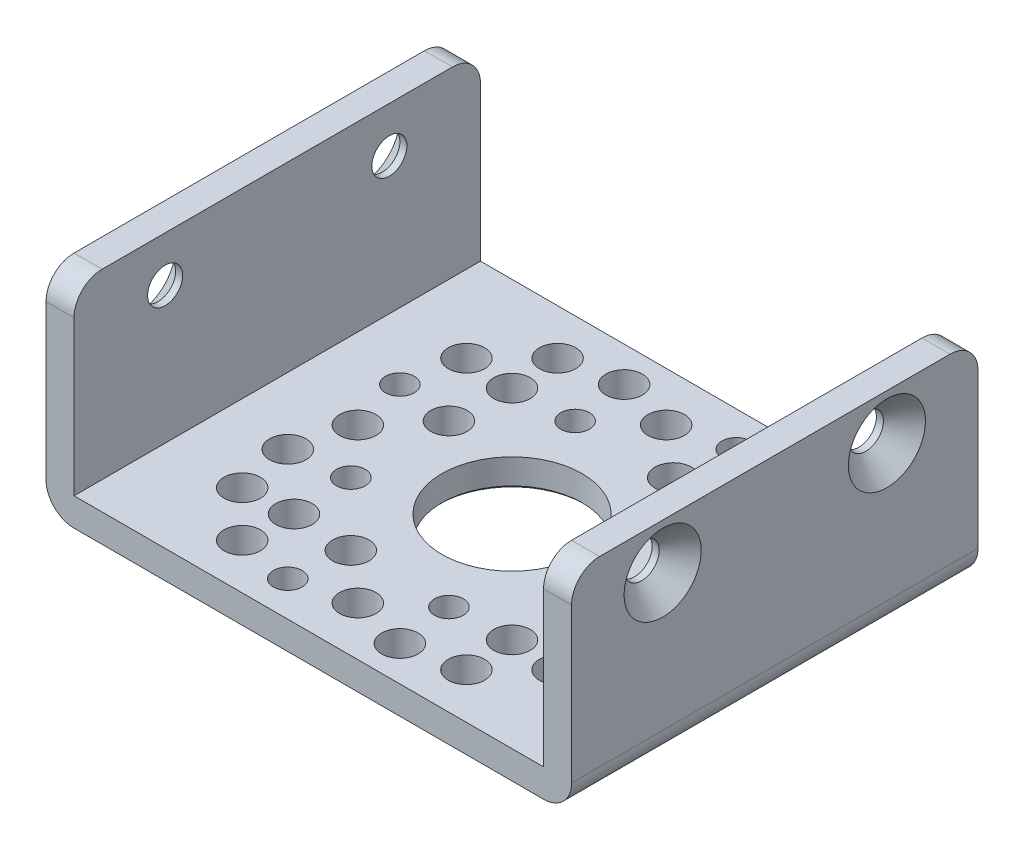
ISO-10303-21;
HEADER;
FILE_DESCRIPTION(('STEP AP214'),'2;1');
FILE_NAME('part.step','',(''),(''),'','','');
FILE_SCHEMA(('AUTOMOTIVE_DESIGN { 1 0 10303 214 1 1 1 1 }'));
ENDSEC;
DATA;
#1=APPLICATION_CONTEXT('core data for automotive mechanical design processes');
#2=APPLICATION_PROTOCOL_DEFINITION('international standard','automotive_design',2000,#1);
#3=PRODUCT_CONTEXT('',#1,'mechanical');
#4=PRODUCT('Part','Part','',(#3));
#5=PRODUCT_RELATED_PRODUCT_CATEGORY('part','',(#4));
#6=PRODUCT_DEFINITION_FORMATION('','',#4);
#7=PRODUCT_DEFINITION_CONTEXT('part definition',#1,'design');
#8=PRODUCT_DEFINITION('design','',#6,#7);
#9=PRODUCT_DEFINITION_SHAPE('','',#8);
#10=(LENGTH_UNIT() NAMED_UNIT(*) SI_UNIT(.MILLI.,.METRE.));
#11=(NAMED_UNIT(*) PLANE_ANGLE_UNIT() SI_UNIT($,.RADIAN.));
#12=(NAMED_UNIT(*) SI_UNIT($,.STERADIAN.) SOLID_ANGLE_UNIT());
#13=UNCERTAINTY_MEASURE_WITH_UNIT(LENGTH_MEASURE(1.E-05),#10,'distance_accuracy_value','');
#14=(GEOMETRIC_REPRESENTATION_CONTEXT(3) GLOBAL_UNCERTAINTY_ASSIGNED_CONTEXT((#13)) GLOBAL_UNIT_ASSIGNED_CONTEXT((#10,
#11,#12)) REPRESENTATION_CONTEXT('',''));
#15=CARTESIAN_POINT('',(0.,0.,0.));
#16=DIRECTION('',(0.,0.,1.));
#17=DIRECTION('',(1.,0.,0.));
#18=AXIS2_PLACEMENT_3D('',#15,#16,#17);
#19=CARTESIAN_POINT('',(-3.5,2.1,-8.));
#20=DIRECTION('',(0.,-1.,0.));
#21=DIRECTION('',(0.,0.,-1.));
#22=AXIS2_PLACEMENT_3D('',#19,#20,#21);
#23=CYLINDRICAL_SURFACE('',#22,1.25);
#24=CARTESIAN_POINT('',(-3.5,0.0999999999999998,-8.));
#25=DIRECTION('',(0.,-1.,0.));
#26=DIRECTION('',(0.,0.,-1.));
#27=AXIS2_PLACEMENT_3D('',#24,#25,#26);
#28=CIRCLE('',#27,1.25);
#29=CARTESIAN_POINT('',(-3.5,0.0999999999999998,-9.25));
#30=VERTEX_POINT('',#29);
#31=EDGE_CURVE('P0_E10',#30,#30,#28,.F.);
#32=ORIENTED_EDGE('',*,*,#31,.T.);
#33=EDGE_LOOP('',(#32));
#34=FACE_BOUND('',#33,.T.);
#35=CARTESIAN_POINT('',(-3.5,2.,-8.));
#36=DIRECTION('',(0.,-1.,0.));
#37=DIRECTION('',(0.,0.,-1.));
#38=AXIS2_PLACEMENT_3D('',#35,#36,#37);
#39=CIRCLE('',#38,1.25);
#40=CARTESIAN_POINT('',(-3.5,2.,-9.25));
#41=VERTEX_POINT('',#40);
#42=EDGE_CURVE('P0_E16',#41,#41,#39,.T.);
#43=ORIENTED_EDGE('',*,*,#42,.T.);
#44=EDGE_LOOP('',(#43));
#45=FACE_BOUND('',#44,.T.);
#46=ADVANCED_FACE('P0_F15',(#34,#45),#23,.T.);
#47=OPEN_SHELL('',(#46));
#48=SHELL_BASED_SURFACE_MODEL('P0_B1',(#47));
#49=CARTESIAN_POINT('',(-8.,2.1,3.5));
#50=DIRECTION('',(0.,-1.,0.));
#51=DIRECTION('',(0.,0.,-1.));
#52=AXIS2_PLACEMENT_3D('',#49,#50,#51);
#53=CYLINDRICAL_SURFACE('',#52,1.25);
#54=CARTESIAN_POINT('',(-8.,0.0999999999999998,3.5));
#55=DIRECTION('',(0.,-1.,0.));
#56=DIRECTION('',(0.,0.,-1.));
#57=AXIS2_PLACEMENT_3D('',#54,#55,#56);
#58=CIRCLE('',#57,1.25);
#59=CARTESIAN_POINT('',(-8.,0.0999999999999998,2.25));
#60=VERTEX_POINT('',#59);
#61=EDGE_CURVE('P1_E10',#60,#60,#58,.F.);
#62=ORIENTED_EDGE('',*,*,#61,.T.);
#63=EDGE_LOOP('',(#62));
#64=FACE_BOUND('',#63,.T.);
#65=CARTESIAN_POINT('',(-8.,2.,3.5));
#66=DIRECTION('',(0.,-1.,0.));
#67=DIRECTION('',(0.,0.,-1.));
#68=AXIS2_PLACEMENT_3D('',#65,#66,#67);
#69=CIRCLE('',#68,1.25);
#70=CARTESIAN_POINT('',(-8.,2.,2.25));
#71=VERTEX_POINT('',#70);
#72=EDGE_CURVE('P1_E16',#71,#71,#69,.T.);
#73=ORIENTED_EDGE('',*,*,#72,.T.);
#74=EDGE_LOOP('',(#73));
#75=FACE_BOUND('',#74,.T.);
#76=ADVANCED_FACE('P1_F15',(#64,#75),#53,.T.);
#77=OPEN_SHELL('',(#76));
#78=SHELL_BASED_SURFACE_MODEL('P1_B1',(#77));
#79=CARTESIAN_POINT('',(4.,2.1,-12.));
#80=DIRECTION('',(0.,-1.,0.));
#81=DIRECTION('',(0.,0.,-1.));
#82=AXIS2_PLACEMENT_3D('',#79,#80,#81);
#83=CYLINDRICAL_SURFACE('',#82,1.25);
#84=CARTESIAN_POINT('',(4.,0.0999999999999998,-12.));
#85=DIRECTION('',(0.,-1.,0.));
#86=DIRECTION('',(0.,0.,-1.));
#87=AXIS2_PLACEMENT_3D('',#84,#85,#86);
#88=CIRCLE('',#87,1.25);
#89=CARTESIAN_POINT('',(4.,0.0999999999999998,-13.25));
#90=VERTEX_POINT('',#89);
#91=EDGE_CURVE('P2_E10',#90,#90,#88,.F.);
#92=ORIENTED_EDGE('',*,*,#91,.T.);
#93=EDGE_LOOP('',(#92));
#94=FACE_BOUND('',#93,.T.);
#95=CARTESIAN_POINT('',(4.,2.,-12.));
#96=DIRECTION('',(0.,-1.,0.));
#97=DIRECTION('',(0.,0.,-1.));
#98=AXIS2_PLACEMENT_3D('',#95,#96,#97);
#99=CIRCLE('',#98,1.25);
#100=CARTESIAN_POINT('',(4.,2.,-13.25));
#101=VERTEX_POINT('',#100);
#102=EDGE_CURVE('P2_E16',#101,#101,#99,.T.);
#103=ORIENTED_EDGE('',*,*,#102,.T.);
#104=EDGE_LOOP('',(#103));
#105=FACE_BOUND('',#104,.T.);
#106=ADVANCED_FACE('P2_F15',(#94,#105),#83,.T.);
#107=OPEN_SHELL('',(#106));
#108=SHELL_BASED_SURFACE_MODEL('P2_B1',(#107));
#109=CARTESIAN_POINT('',(8.,2.1,-3.5));
#110=DIRECTION('',(0.,-1.,0.));
#111=DIRECTION('',(0.,0.,-1.));
#112=AXIS2_PLACEMENT_3D('',#109,#110,#111);
#113=CYLINDRICAL_SURFACE('',#112,1.25);
#114=CARTESIAN_POINT('',(8.,0.0999999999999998,-3.5));
#115=DIRECTION('',(0.,-1.,0.));
#116=DIRECTION('',(0.,0.,-1.));
#117=AXIS2_PLACEMENT_3D('',#114,#115,#116);
#118=CIRCLE('',#117,1.25);
#119=CARTESIAN_POINT('',(8.,0.0999999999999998,-4.75));
#120=VERTEX_POINT('',#119);
#121=EDGE_CURVE('P3_E10',#120,#120,#118,.F.);
#122=ORIENTED_EDGE('',*,*,#121,.T.);
#123=EDGE_LOOP('',(#122));
#124=FACE_BOUND('',#123,.T.);
#125=CARTESIAN_POINT('',(8.,2.,-3.5));
#126=DIRECTION('',(0.,-1.,0.));
#127=DIRECTION('',(0.,0.,-1.));
#128=AXIS2_PLACEMENT_3D('',#125,#126,#127);
#129=CIRCLE('',#128,1.25);
#130=CARTESIAN_POINT('',(8.,2.,-4.75));
#131=VERTEX_POINT('',#130);
#132=EDGE_CURVE('P3_E16',#131,#131,#129,.T.);
#133=ORIENTED_EDGE('',*,*,#132,.T.);
#134=EDGE_LOOP('',(#133));
#135=FACE_BOUND('',#134,.T.);
#136=ADVANCED_FACE('P3_F15',(#124,#135),#113,.T.);
#137=OPEN_SHELL('',(#136));
#138=SHELL_BASED_SURFACE_MODEL('P3_B1',(#137));
#139=CARTESIAN_POINT('',(12.,2.1,4.));
#140=DIRECTION('',(0.,-1.,0.));
#141=DIRECTION('',(0.,0.,-1.));
#142=AXIS2_PLACEMENT_3D('',#139,#140,#141);
#143=CYLINDRICAL_SURFACE('',#142,1.25);
#144=CARTESIAN_POINT('',(12.,0.0999999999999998,4.));
#145=DIRECTION('',(0.,-1.,0.));
#146=DIRECTION('',(0.,0.,-1.));
#147=AXIS2_PLACEMENT_3D('',#144,#145,#146);
#148=CIRCLE('',#147,1.25);
#149=CARTESIAN_POINT('',(12.,0.0999999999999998,2.75));
#150=VERTEX_POINT('',#149);
#151=EDGE_CURVE('P4_E10',#150,#150,#148,.F.);
#152=ORIENTED_EDGE('',*,*,#151,.T.);
#153=EDGE_LOOP('',(#152));
#154=FACE_BOUND('',#153,.T.);
#155=CARTESIAN_POINT('',(12.,2.,4.));
#156=DIRECTION('',(0.,-1.,0.));
#157=DIRECTION('',(0.,0.,-1.));
#158=AXIS2_PLACEMENT_3D('',#155,#156,#157);
#159=CIRCLE('',#158,1.25);
#160=CARTESIAN_POINT('',(12.,2.,2.75));
#161=VERTEX_POINT('',#160);
#162=EDGE_CURVE('P4_E16',#161,#161,#159,.T.);
#163=ORIENTED_EDGE('',*,*,#162,.T.);
#164=EDGE_LOOP('',(#163));
#165=FACE_BOUND('',#164,.T.);
#166=ADVANCED_FACE('P4_F15',(#154,#165),#143,.T.);
#167=OPEN_SHELL('',(#166));
#168=SHELL_BASED_SURFACE_MODEL('P4_B1',(#167));
#169=CARTESIAN_POINT('',(3.5,2.1,8.));
#170=DIRECTION('',(0.,-1.,0.));
#171=DIRECTION('',(0.,0.,-1.));
#172=AXIS2_PLACEMENT_3D('',#169,#170,#171);
#173=CYLINDRICAL_SURFACE('',#172,1.25);
#174=CARTESIAN_POINT('',(3.5,0.0999999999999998,8.));
#175=DIRECTION('',(0.,-1.,0.));
#176=DIRECTION('',(0.,0.,-1.));
#177=AXIS2_PLACEMENT_3D('',#174,#175,#176);
#178=CIRCLE('',#177,1.25);
#179=CARTESIAN_POINT('',(3.5,0.0999999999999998,6.75));
#180=VERTEX_POINT('',#179);
#181=EDGE_CURVE('P5_E10',#180,#180,#178,.F.);
#182=ORIENTED_EDGE('',*,*,#181,.T.);
#183=EDGE_LOOP('',(#182));
#184=FACE_BOUND('',#183,.T.);
#185=CARTESIAN_POINT('',(3.5,2.,8.));
#186=DIRECTION('',(0.,-1.,0.));
#187=DIRECTION('',(0.,0.,-1.));
#188=AXIS2_PLACEMENT_3D('',#185,#186,#187);
#189=CIRCLE('',#188,1.25);
#190=CARTESIAN_POINT('',(3.5,2.,6.75));
#191=VERTEX_POINT('',#190);
#192=EDGE_CURVE('P5_E16',#191,#191,#189,.T.);
#193=ORIENTED_EDGE('',*,*,#192,.T.);
#194=EDGE_LOOP('',(#193));
#195=FACE_BOUND('',#194,.T.);
#196=ADVANCED_FACE('P5_F15',(#184,#195),#173,.T.);
#197=OPEN_SHELL('',(#196));
#198=SHELL_BASED_SURFACE_MODEL('P5_B1',(#197));
#199=CARTESIAN_POINT('',(-12.,2.1,-4.));
#200=DIRECTION('',(0.,-1.,0.));
#201=DIRECTION('',(0.,0.,-1.));
#202=AXIS2_PLACEMENT_3D('',#199,#200,#201);
#203=CYLINDRICAL_SURFACE('',#202,1.25);
#204=CARTESIAN_POINT('',(-12.,0.0999999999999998,-4.));
#205=DIRECTION('',(0.,-1.,0.));
#206=DIRECTION('',(0.,0.,-1.));
#207=AXIS2_PLACEMENT_3D('',#204,#205,#206);
#208=CIRCLE('',#207,1.25);
#209=CARTESIAN_POINT('',(-12.,0.0999999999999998,-5.25));
#210=VERTEX_POINT('',#209);
#211=EDGE_CURVE('P6_E10',#210,#210,#208,.F.);
#212=ORIENTED_EDGE('',*,*,#211,.T.);
#213=EDGE_LOOP('',(#212));
#214=FACE_BOUND('',#213,.T.);
#215=CARTESIAN_POINT('',(-12.,2.,-4.));
#216=DIRECTION('',(0.,-1.,0.));
#217=DIRECTION('',(0.,0.,-1.));
#218=AXIS2_PLACEMENT_3D('',#215,#216,#217);
#219=CIRCLE('',#218,1.25);
#220=CARTESIAN_POINT('',(-12.,2.,-5.25));
#221=VERTEX_POINT('',#220);
#222=EDGE_CURVE('P6_E16',#221,#221,#219,.T.);
#223=ORIENTED_EDGE('',*,*,#222,.T.);
#224=EDGE_LOOP('',(#223));
#225=FACE_BOUND('',#224,.T.);
#226=ADVANCED_FACE('P6_F15',(#214,#225),#203,.T.);
#227=OPEN_SHELL('',(#226));
#228=SHELL_BASED_SURFACE_MODEL('P6_B1',(#227));
#229=CARTESIAN_POINT('',(-4.,2.1,12.));
#230=DIRECTION('',(0.,-1.,0.));
#231=DIRECTION('',(0.,0.,-1.));
#232=AXIS2_PLACEMENT_3D('',#229,#230,#231);
#233=CYLINDRICAL_SURFACE('',#232,1.25);
#234=CARTESIAN_POINT('',(-4.,0.0999999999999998,12.));
#235=DIRECTION('',(0.,-1.,0.));
#236=DIRECTION('',(0.,0.,-1.));
#237=AXIS2_PLACEMENT_3D('',#234,#235,#236);
#238=CIRCLE('',#237,1.25);
#239=CARTESIAN_POINT('',(-4.,0.0999999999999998,10.75));
#240=VERTEX_POINT('',#239);
#241=EDGE_CURVE('P7_E10',#240,#240,#238,.F.);
#242=ORIENTED_EDGE('',*,*,#241,.T.);
#243=EDGE_LOOP('',(#242));
#244=FACE_BOUND('',#243,.T.);
#245=CARTESIAN_POINT('',(-4.,2.,12.));
#246=DIRECTION('',(0.,-1.,0.));
#247=DIRECTION('',(0.,0.,-1.));
#248=AXIS2_PLACEMENT_3D('',#245,#246,#247);
#249=CIRCLE('',#248,1.25);
#250=CARTESIAN_POINT('',(-4.,2.,10.75));
#251=VERTEX_POINT('',#250);
#252=EDGE_CURVE('P7_E16',#251,#251,#249,.T.);
#253=ORIENTED_EDGE('',*,*,#252,.T.);
#254=EDGE_LOOP('',(#253));
#255=FACE_BOUND('',#254,.T.);
#256=ADVANCED_FACE('P7_F15',(#244,#255),#233,.T.);
#257=OPEN_SHELL('',(#256));
#258=SHELL_BASED_SURFACE_MODEL('P7_B1',(#257));
#259=CARTESIAN_POINT('',(-18.7499999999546,11.75,8.));
#260=DIRECTION('',(-1.,0.,0.));
#261=DIRECTION('',(0.,0.,1.));
#262=AXIS2_PLACEMENT_3D('',#259,#260,#261);
#263=CONICAL_SURFACE('',#262,2.75000000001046,0.785398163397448);
#264=CARTESIAN_POINT('',(-18.7500000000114,11.75,8.));
#265=DIRECTION('',(-1.,0.,0.));
#266=DIRECTION('',(0.,0.,1.));
#267=AXIS2_PLACEMENT_3D('',#264,#265,#266);
#268=CIRCLE('',#267,2.7500000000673);
#269=CARTESIAN_POINT('',(-18.7500000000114,11.75,10.7500000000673));
#270=VERTEX_POINT('',#269);
#271=EDGE_CURVE('P8_E421',#270,#270,#268,.T.);
#272=ORIENTED_EDGE('',*,*,#271,.T.);
#273=EDGE_LOOP('',(#272));
#274=FACE_BOUND('',#273,.T.);
#275=CARTESIAN_POINT('',(-17.2499999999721,11.75,8.));
#276=DIRECTION('',(-1.,0.,0.));
#277=DIRECTION('',(0.,0.,1.));
#278=AXIS2_PLACEMENT_3D('',#275,#276,#277);
#279=CIRCLE('',#278,1.25000000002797);
#280=CARTESIAN_POINT('',(-17.2499999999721,11.75,9.25000000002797));
#281=VERTEX_POINT('',#280);
#282=EDGE_CURVE('P8_E441',#281,#281,#279,.F.);
#283=ORIENTED_EDGE('',*,*,#282,.T.);
#284=EDGE_LOOP('',(#283));
#285=FACE_BOUND('',#284,.T.);
#286=ADVANCED_FACE('P8_F17',(#274,#285),#263,.F.);
#287=CARTESIAN_POINT('',(-18.7500000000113,11.75,-8.));
#288=DIRECTION('',(-1.,0.,0.));
#289=DIRECTION('',(0.,0.,1.));
#290=AXIS2_PLACEMENT_3D('',#287,#288,#289);
#291=CONICAL_SURFACE('',#290,2.75000000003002,0.785398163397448);
#292=CARTESIAN_POINT('',(-18.7500000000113,11.75,-8.));
#293=DIRECTION('',(-1.,0.,0.));
#294=DIRECTION('',(0.,0.,1.));
#295=AXIS2_PLACEMENT_3D('',#292,#293,#294);
#296=CIRCLE('',#295,2.75000000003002);
#297=CARTESIAN_POINT('',(-18.7500000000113,11.75,-5.24999999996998));
#298=VERTEX_POINT('',#297);
#299=EDGE_CURVE('P8_E138',#298,#298,#296,.T.);
#300=ORIENTED_EDGE('',*,*,#299,.T.);
#301=EDGE_LOOP('',(#300));
#302=FACE_BOUND('',#301,.T.);
#303=CARTESIAN_POINT('',(-17.2499999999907,11.75,-8.));
#304=DIRECTION('',(-1.,0.,0.));
#305=DIRECTION('',(0.,0.,1.));
#306=AXIS2_PLACEMENT_3D('',#303,#304,#305);
#307=CIRCLE('',#306,1.25000000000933);
#308=CARTESIAN_POINT('',(-17.2499999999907,11.75,-6.74999999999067));
#309=VERTEX_POINT('',#308);
#310=EDGE_CURVE('P8_E437',#309,#309,#307,.F.);
#311=ORIENTED_EDGE('',*,*,#310,.T.);
#312=EDGE_LOOP('',(#311));
#313=FACE_BOUND('',#312,.T.);
#314=ADVANCED_FACE('P8_F873',(#302,#313),#291,.F.);
#315=CARTESIAN_POINT('',(18.7499999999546,11.75,8.));
#316=DIRECTION('',(1.,0.,0.));
#317=DIRECTION('',(0.,0.,-1.));
#318=AXIS2_PLACEMENT_3D('',#315,#316,#317);
#319=CONICAL_SURFACE('',#318,2.75000000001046,0.785398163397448);
#320=CARTESIAN_POINT('',(17.2499999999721,11.75,8.));
#321=DIRECTION('',(1.,0.,0.));
#322=DIRECTION('',(0.,0.,-1.));
#323=AXIS2_PLACEMENT_3D('',#320,#321,#322);
#324=CIRCLE('',#323,1.25000000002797);
#325=CARTESIAN_POINT('',(17.2499999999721,11.75,6.74999999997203));
#326=VERTEX_POINT('',#325);
#327=EDGE_CURVE('P8_E389',#326,#326,#324,.F.);
#328=ORIENTED_EDGE('',*,*,#327,.T.);
#329=EDGE_LOOP('',(#328));
#330=FACE_BOUND('',#329,.T.);
#331=CARTESIAN_POINT('',(18.7500000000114,11.75,8.));
#332=DIRECTION('',(1.,0.,0.));
#333=DIRECTION('',(0.,0.,-1.));
#334=AXIS2_PLACEMENT_3D('',#331,#332,#333);
#335=CIRCLE('',#334,2.7500000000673);
#336=CARTESIAN_POINT('',(18.7500000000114,11.75,5.2499999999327));
#337=VERTEX_POINT('',#336);
#338=EDGE_CURVE('P8_E433',#337,#337,#335,.T.);
#339=ORIENTED_EDGE('',*,*,#338,.T.);
#340=EDGE_LOOP('',(#339));
#341=FACE_BOUND('',#340,.T.);
#342=ADVANCED_FACE('P8_F875',(#330,#341),#319,.F.);
#343=CARTESIAN_POINT('',(18.7500000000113,11.75,-8.));
#344=DIRECTION('',(1.,0.,0.));
#345=DIRECTION('',(0.,0.,-1.));
#346=AXIS2_PLACEMENT_3D('',#343,#344,#345);
#347=CONICAL_SURFACE('',#346,2.75000000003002,0.785398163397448);
#348=CARTESIAN_POINT('',(18.7500000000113,11.75,-8.));
#349=DIRECTION('',(1.,0.,0.));
#350=DIRECTION('',(0.,0.,-1.));
#351=AXIS2_PLACEMENT_3D('',#348,#349,#350);
#352=CIRCLE('',#351,2.75000000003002);
#353=CARTESIAN_POINT('',(18.7500000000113,11.75,-10.75000000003));
#354=VERTEX_POINT('',#353);
#355=EDGE_CURVE('P8_E429',#354,#354,#352,.T.);
#356=ORIENTED_EDGE('',*,*,#355,.T.);
#357=EDGE_LOOP('',(#356));
#358=FACE_BOUND('',#357,.T.);
#359=CARTESIAN_POINT('',(17.2499999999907,11.75,-8.));
#360=DIRECTION('',(1.,0.,0.));
#361=DIRECTION('',(0.,0.,-1.));
#362=AXIS2_PLACEMENT_3D('',#359,#360,#361);
#363=CIRCLE('',#362,1.25000000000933);
#364=CARTESIAN_POINT('',(17.2499999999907,11.75,-9.25000000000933));
#365=VERTEX_POINT('',#364);
#366=EDGE_CURVE('P8_E385',#365,#365,#363,.F.);
#367=ORIENTED_EDGE('',*,*,#366,.T.);
#368=EDGE_LOOP('',(#367));
#369=FACE_BOUND('',#368,.T.);
#370=ADVANCED_FACE('P8_F881',(#358,#369),#347,.F.);
#371=CARTESIAN_POINT('',(0.,5.6843418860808E-11,0.));
#372=DIRECTION('',(0.,-1.,0.));
#373=DIRECTION('',(0.,0.,-1.));
#374=AXIS2_PLACEMENT_3D('',#371,#372,#373);
#375=CONICAL_SURFACE('',#374,5.19999999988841,0.785398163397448);
#376=CARTESIAN_POINT('',(0.,0.,0.));
#377=DIRECTION('',(0.,-1.,0.));
#378=DIRECTION('',(0.,0.,-1.));
#379=AXIS2_PLACEMENT_3D('',#376,#377,#378);
#380=CIRCLE('',#379,5.19999999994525);
#381=CARTESIAN_POINT('',(0.,0.,-5.19999999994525));
#382=VERTEX_POINT('',#381);
#383=EDGE_CURVE('P8_E346',#382,#382,#380,.F.);
#384=ORIENTED_EDGE('',*,*,#383,.F.);
#385=EDGE_LOOP('',(#384));
#386=FACE_BOUND('',#385,.T.);
#387=CARTESIAN_POINT('',(0.,0.199999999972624,0.));
#388=DIRECTION('',(0.,-1.,0.));
#389=DIRECTION('',(0.,0.,-1.));
#390=AXIS2_PLACEMENT_3D('',#387,#388,#389);
#391=CIRCLE('',#390,4.99999999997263);
#392=CARTESIAN_POINT('',(0.,0.199999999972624,-4.99999999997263));
#393=VERTEX_POINT('',#392);
#394=EDGE_CURVE('P8_E342',#393,#393,#391,.F.);
#395=ORIENTED_EDGE('',*,*,#394,.T.);
#396=EDGE_LOOP('',(#395));
#397=FACE_BOUND('',#396,.T.);
#398=ADVANCED_FACE('P8_F888',(#386,#397),#375,.F.);
#399=CARTESIAN_POINT('',(3.5,1.13686837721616E-10,8.));
#400=DIRECTION('',(0.,-1.,0.));
#401=DIRECTION('',(0.,0.,-1.));
#402=AXIS2_PLACEMENT_3D('',#399,#400,#401);
#403=CONICAL_SURFACE('',#402,1.34999999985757,0.785398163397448);
#404=CARTESIAN_POINT('',(3.5,-8.77661658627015E-11,8.));
#405=DIRECTION('',(0.,-1.,0.));
#406=DIRECTION('',(0.,0.,-1.));
#407=AXIS2_PLACEMENT_3D('',#404,#405,#406);
#408=CIRCLE('',#407,1.35000000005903);
#409=CARTESIAN_POINT('',(3.5,-8.77661658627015E-11,6.64999999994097));
#410=VERTEX_POINT('',#409);
#411=EDGE_CURVE('P8_E350',#410,#410,#408,.F.);
#412=ORIENTED_EDGE('',*,*,#411,.F.);
#413=EDGE_LOOP('',(#412));
#414=FACE_BOUND('',#413,.T.);
#415=CARTESIAN_POINT('',(3.5,0.32499999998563,8.));
#416=DIRECTION('',(0.,-1.,0.));
#417=DIRECTION('',(0.,0.,-1.));
#418=AXIS2_PLACEMENT_3D('',#415,#416,#417);
#419=CIRCLE('',#418,1.02499999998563);
#420=CARTESIAN_POINT('',(3.5,0.32499999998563,6.97500000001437));
#421=VERTEX_POINT('',#420);
#422=EDGE_CURVE('P8_E306',#421,#421,#419,.F.);
#423=ORIENTED_EDGE('',*,*,#422,.T.);
#424=EDGE_LOOP('',(#423));
#425=FACE_BOUND('',#424,.T.);
#426=ADVANCED_FACE('P8_F892',(#414,#425),#403,.F.);
#427=CARTESIAN_POINT('',(-8.,1.13686837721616E-10,3.5));
#428=DIRECTION('',(0.,-1.,0.));
#429=DIRECTION('',(0.,0.,-1.));
#430=AXIS2_PLACEMENT_3D('',#427,#428,#429);
#431=CONICAL_SURFACE('',#430,1.34999999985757,0.785398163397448);
#432=CARTESIAN_POINT('',(-8.,-8.77657321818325E-11,3.5));
#433=DIRECTION('',(0.,-1.,0.));
#434=DIRECTION('',(0.,0.,-1.));
#435=AXIS2_PLACEMENT_3D('',#432,#433,#434);
#436=CIRCLE('',#435,1.35000000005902);
#437=CARTESIAN_POINT('',(-8.,-8.77657321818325E-11,2.14999999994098));
#438=VERTEX_POINT('',#437);
#439=EDGE_CURVE('P8_E354',#438,#438,#436,.F.);
#440=ORIENTED_EDGE('',*,*,#439,.F.);
#441=EDGE_LOOP('',(#440));
#442=FACE_BOUND('',#441,.T.);
#443=CARTESIAN_POINT('',(-8.,0.32499999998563,3.5));
#444=DIRECTION('',(0.,-1.,0.));
#445=DIRECTION('',(0.,0.,-1.));
#446=AXIS2_PLACEMENT_3D('',#443,#444,#445);
#447=CIRCLE('',#446,1.02499999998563);
#448=CARTESIAN_POINT('',(-8.,0.32499999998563,2.47500000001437));
#449=VERTEX_POINT('',#448);
#450=EDGE_CURVE('P8_E302',#449,#449,#447,.F.);
#451=ORIENTED_EDGE('',*,*,#450,.T.);
#452=EDGE_LOOP('',(#451));
#453=FACE_BOUND('',#452,.T.);
#454=ADVANCED_FACE('P8_F896',(#442,#453),#431,.F.);
#455=CARTESIAN_POINT('',(-3.5,1.13686837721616E-10,-8.));
#456=DIRECTION('',(0.,-1.,0.));
#457=DIRECTION('',(0.,0.,-1.));
#458=AXIS2_PLACEMENT_3D('',#455,#456,#457);
#459=CONICAL_SURFACE('',#458,1.34999999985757,0.785398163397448);
#460=CARTESIAN_POINT('',(-3.5,-8.77661658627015E-11,-8.));
#461=DIRECTION('',(0.,-1.,0.));
#462=DIRECTION('',(0.,0.,-1.));
#463=AXIS2_PLACEMENT_3D('',#460,#461,#462);
#464=CIRCLE('',#463,1.35000000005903);
#465=CARTESIAN_POINT('',(-3.5,-8.77661658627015E-11,-9.35000000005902));
#466=VERTEX_POINT('',#465);
#467=EDGE_CURVE('P8_E358',#466,#466,#464,.F.);
#468=ORIENTED_EDGE('',*,*,#467,.F.);
#469=EDGE_LOOP('',(#468));
#470=FACE_BOUND('',#469,.T.);
#471=CARTESIAN_POINT('',(-3.5,0.32499999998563,-8.));
#472=DIRECTION('',(0.,-1.,0.));
#473=DIRECTION('',(0.,0.,-1.));
#474=AXIS2_PLACEMENT_3D('',#471,#472,#473);
#475=CIRCLE('',#474,1.02499999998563);
#476=CARTESIAN_POINT('',(-3.5,0.32499999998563,-9.02499999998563));
#477=VERTEX_POINT('',#476);
#478=EDGE_CURVE('P8_E298',#477,#477,#475,.F.);
#479=ORIENTED_EDGE('',*,*,#478,.T.);
#480=EDGE_LOOP('',(#479));
#481=FACE_BOUND('',#480,.T.);
#482=ADVANCED_FACE('P8_F900',(#470,#481),#459,.F.);
#483=CARTESIAN_POINT('',(8.,1.13686837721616E-10,-3.5));
#484=DIRECTION('',(0.,-1.,0.));
#485=DIRECTION('',(0.,0.,-1.));
#486=AXIS2_PLACEMENT_3D('',#483,#484,#485);
#487=CONICAL_SURFACE('',#486,1.34999999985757,0.785398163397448);
#488=CARTESIAN_POINT('',(8.,-8.77657321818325E-11,-3.5));
#489=DIRECTION('',(0.,-1.,0.));
#490=DIRECTION('',(0.,0.,-1.));
#491=AXIS2_PLACEMENT_3D('',#488,#489,#490);
#492=CIRCLE('',#491,1.35000000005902);
#493=CARTESIAN_POINT('',(8.,-8.77657321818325E-11,-4.85000000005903));
#494=VERTEX_POINT('',#493);
#495=EDGE_CURVE('P8_E362',#494,#494,#492,.F.);
#496=ORIENTED_EDGE('',*,*,#495,.F.);
#497=EDGE_LOOP('',(#496));
#498=FACE_BOUND('',#497,.T.);
#499=CARTESIAN_POINT('',(8.,0.32499999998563,-3.5));
#500=DIRECTION('',(0.,-1.,0.));
#501=DIRECTION('',(0.,0.,-1.));
#502=AXIS2_PLACEMENT_3D('',#499,#500,#501);
#503=CIRCLE('',#502,1.02499999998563);
#504=CARTESIAN_POINT('',(8.,0.32499999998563,-4.52499999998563));
#505=VERTEX_POINT('',#504);
#506=EDGE_CURVE('P8_E294',#505,#505,#503,.F.);
#507=ORIENTED_EDGE('',*,*,#506,.T.);
#508=EDGE_LOOP('',(#507));
#509=FACE_BOUND('',#508,.T.);
#510=ADVANCED_FACE('P8_F904',(#498,#509),#487,.F.);
#511=CARTESIAN_POINT('',(4.,5.6843418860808E-11,-12.));
#512=DIRECTION('',(0.,-1.,0.));
#513=DIRECTION('',(0.,0.,-1.));
#514=AXIS2_PLACEMENT_3D('',#511,#512,#513);
#515=CONICAL_SURFACE('',#514,1.34999999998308,0.7853981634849);
#516=CARTESIAN_POINT('',(4.,5.68432020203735E-11,-12.));
#517=DIRECTION('',(0.,-1.,0.));
#518=DIRECTION('',(0.,0.,-1.));
#519=AXIS2_PLACEMENT_3D('',#516,#517,#518);
#520=CIRCLE('',#519,1.34999999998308);
#521=CARTESIAN_POINT('',(4.,5.68432020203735E-11,-13.3499999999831));
#522=VERTEX_POINT('',#521);
#523=EDGE_CURVE('P8_E366',#522,#522,#520,.F.);
#524=ORIENTED_EDGE('',*,*,#523,.F.);
#525=EDGE_LOOP('',(#524));
#526=FACE_BOUND('',#525,.T.);
#527=CARTESIAN_POINT('',(4.,0.324999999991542,-12.));
#528=DIRECTION('',(0.,-1.,0.));
#529=DIRECTION('',(0.,0.,-1.));
#530=AXIS2_PLACEMENT_3D('',#527,#528,#529);
#531=CIRCLE('',#530,1.02499999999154);
#532=CARTESIAN_POINT('',(4.,0.324999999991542,-13.0249999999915));
#533=VERTEX_POINT('',#532);
#534=EDGE_CURVE('P8_E226',#533,#533,#531,.F.);
#535=ORIENTED_EDGE('',*,*,#534,.T.);
#536=EDGE_LOOP('',(#535));
#537=FACE_BOUND('',#536,.T.);
#538=ADVANCED_FACE('P8_F908',(#526,#537),#515,.F.);
#539=CARTESIAN_POINT('',(12.,5.6843418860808E-11,4.));
#540=DIRECTION('',(0.,-1.,0.));
#541=DIRECTION('',(0.,0.,-1.));
#542=AXIS2_PLACEMENT_3D('',#539,#540,#541);
#543=CONICAL_SURFACE('',#542,1.34999999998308,0.7853981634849);
#544=CARTESIAN_POINT('',(12.,5.68432020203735E-11,4.));
#545=DIRECTION('',(0.,-1.,0.));
#546=DIRECTION('',(0.,0.,-1.));
#547=AXIS2_PLACEMENT_3D('',#544,#545,#546);
#548=CIRCLE('',#547,1.34999999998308);
#549=CARTESIAN_POINT('',(12.,5.68432020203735E-11,2.65000000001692));
#550=VERTEX_POINT('',#549);
#551=EDGE_CURVE('P8_E370',#550,#550,#548,.F.);
#552=ORIENTED_EDGE('',*,*,#551,.F.);
#553=EDGE_LOOP('',(#552));
#554=FACE_BOUND('',#553,.T.);
#555=CARTESIAN_POINT('',(12.,0.324999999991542,4.));
#556=DIRECTION('',(0.,-1.,0.));
#557=DIRECTION('',(0.,0.,-1.));
#558=AXIS2_PLACEMENT_3D('',#555,#556,#557);
#559=CIRCLE('',#558,1.02499999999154);
#560=CARTESIAN_POINT('',(12.,0.324999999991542,2.97500000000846));
#561=VERTEX_POINT('',#560);
#562=EDGE_CURVE('P8_E222',#561,#561,#559,.F.);
#563=ORIENTED_EDGE('',*,*,#562,.T.);
#564=EDGE_LOOP('',(#563));
#565=FACE_BOUND('',#564,.T.);
#566=ADVANCED_FACE('P8_F912',(#554,#565),#543,.F.);
#567=CARTESIAN_POINT('',(-4.,5.6843418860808E-11,12.));
#568=DIRECTION('',(0.,-1.,0.));
#569=DIRECTION('',(0.,0.,-1.));
#570=AXIS2_PLACEMENT_3D('',#567,#568,#569);
#571=CONICAL_SURFACE('',#570,1.34999999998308,0.7853981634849);
#572=CARTESIAN_POINT('',(-4.,5.68432020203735E-11,12.));
#573=DIRECTION('',(0.,-1.,0.));
#574=DIRECTION('',(0.,0.,-1.));
#575=AXIS2_PLACEMENT_3D('',#572,#573,#574);
#576=CIRCLE('',#575,1.34999999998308);
#577=CARTESIAN_POINT('',(-4.,5.68432020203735E-11,10.6500000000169));
#578=VERTEX_POINT('',#577);
#579=EDGE_CURVE('P8_E374',#578,#578,#576,.F.);
#580=ORIENTED_EDGE('',*,*,#579,.F.);
#581=EDGE_LOOP('',(#580));
#582=FACE_BOUND('',#581,.T.);
#583=CARTESIAN_POINT('',(-4.,0.324999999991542,12.));
#584=DIRECTION('',(0.,-1.,0.));
#585=DIRECTION('',(0.,0.,-1.));
#586=AXIS2_PLACEMENT_3D('',#583,#584,#585);
#587=CIRCLE('',#586,1.02499999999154);
#588=CARTESIAN_POINT('',(-4.,0.324999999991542,10.9750000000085));
#589=VERTEX_POINT('',#588);
#590=EDGE_CURVE('P8_E218',#589,#589,#587,.F.);
#591=ORIENTED_EDGE('',*,*,#590,.T.);
#592=EDGE_LOOP('',(#591));
#593=FACE_BOUND('',#592,.T.);
#594=ADVANCED_FACE('P8_F916',(#582,#593),#571,.F.);
#595=CARTESIAN_POINT('',(67.635,13.,-12.5));
#596=DIRECTION('',(-1.,0.,0.));
#597=DIRECTION('',(0.,0.,1.));
#598=AXIS2_PLACEMENT_3D('',#595,#596,#597);
#599=CYLINDRICAL_SURFACE('',#598,2.);
#600=DIRECTION('',(-1.,0.,0.));
#601=VECTOR('',#600,1.);
#602=CARTESIAN_POINT('',(67.635,15.,-12.5));
#603=LINE('',#602,#601);
#604=CARTESIAN_POINT('',(-18.75,15.,-12.5));
#605=VERTEX_POINT('',#604);
#606=CARTESIAN_POINT('',(-16.75,15.,-12.5));
#607=VERTEX_POINT('',#606);
#608=EDGE_CURVE('P8_E125',#605,#607,#603,.F.);
#609=ORIENTED_EDGE('',*,*,#608,.T.);
#610=CARTESIAN_POINT('',(-16.75,13.,-12.5));
#611=DIRECTION('',(-1.,0.,0.));
#612=DIRECTION('',(0.,0.,1.));
#613=AXIS2_PLACEMENT_3D('',#610,#611,#612);
#614=CIRCLE('',#613,2.);
#615=CARTESIAN_POINT('',(-16.75,13.,-14.5));
#616=VERTEX_POINT('',#615);
#617=EDGE_CURVE('P8_E122',#616,#607,#614,.F.);
#618=ORIENTED_EDGE('',*,*,#617,.F.);
#619=DIRECTION('',(-1.,0.,0.));
#620=VECTOR('',#619,1.);
#621=CARTESIAN_POINT('',(67.635,13.,-14.5));
#622=LINE('',#621,#620);
#623=CARTESIAN_POINT('',(-18.75,13.,-14.5));
#624=VERTEX_POINT('',#623);
#625=EDGE_CURVE('P8_E20',#616,#624,#622,.T.);
#626=ORIENTED_EDGE('',*,*,#625,.T.);
#627=CARTESIAN_POINT('',(-18.75,13.,-12.5));
#628=DIRECTION('',(-1.,0.,0.));
#629=DIRECTION('',(0.,0.,1.));
#630=AXIS2_PLACEMENT_3D('',#627,#628,#629);
#631=CIRCLE('',#630,2.);
#632=EDGE_CURVE('P8_E119',#624,#605,#631,.F.);
#633=ORIENTED_EDGE('',*,*,#632,.T.);
#634=EDGE_LOOP('',(#609,#618,#626,#633));
#635=FACE_BOUND('',#634,.T.);
#636=ADVANCED_FACE('P8_F118',(#635),#599,.T.);
#637=CARTESIAN_POINT('',(-17.75,15.,0.));
#638=DIRECTION('',(0.,-1.,0.));
#639=DIRECTION('',(0.,0.,-1.));
#640=AXIS2_PLACEMENT_3D('',#637,#638,#639);
#641=PLANE('',#640);
#642=DIRECTION('',(0.,0.,1.));
#643=VECTOR('',#642,1.);
#644=CARTESIAN_POINT('',(-16.75,15.,-14.5));
#645=LINE('',#644,#643);
#646=CARTESIAN_POINT('',(-16.75,15.,12.5));
#647=VERTEX_POINT('',#646);
#648=EDGE_CURVE('P8_E185',#607,#647,#645,.T.);
#649=ORIENTED_EDGE('',*,*,#648,.F.);
#650=ORIENTED_EDGE('',*,*,#608,.F.);
#651=DIRECTION('',(0.,0.,-1.));
#652=VECTOR('',#651,1.);
#653=CARTESIAN_POINT('',(-18.75,15.,0.));
#654=LINE('',#653,#652);
#655=CARTESIAN_POINT('',(-18.75,15.,12.5));
#656=VERTEX_POINT('',#655);
#657=EDGE_CURVE('P8_E136',#605,#656,#654,.F.);
#658=ORIENTED_EDGE('',*,*,#657,.T.);
#659=DIRECTION('',(-1.,0.,0.));
#660=VECTOR('',#659,1.);
#661=CARTESIAN_POINT('',(62.88130207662,15.,12.5));
#662=LINE('',#661,#660);
#663=EDGE_CURVE('P8_E445',#647,#656,#662,.T.);
#664=ORIENTED_EDGE('',*,*,#663,.F.);
#665=EDGE_LOOP('',(#649,#650,#658,#664));
#666=FACE_BOUND('',#665,.T.);
#667=ADVANCED_FACE('P8_F453',(#666),#641,.F.);
#668=CARTESIAN_POINT('',(62.88130207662,13.,12.5));
#669=DIRECTION('',(-1.,0.,0.));
#670=DIRECTION('',(0.,0.,1.));
#671=AXIS2_PLACEMENT_3D('',#668,#669,#670);
#672=CYLINDRICAL_SURFACE('',#671,2.);
#673=DIRECTION('',(-1.,0.,0.));
#674=VECTOR('',#673,1.);
#675=CARTESIAN_POINT('',(62.88130207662,13.,14.5));
#676=LINE('',#675,#674);
#677=CARTESIAN_POINT('',(-18.75,13.,14.5));
#678=VERTEX_POINT('',#677);
#679=CARTESIAN_POINT('',(-16.75,13.,14.5));
#680=VERTEX_POINT('',#679);
#681=EDGE_CURVE('P8_E195',#678,#680,#676,.F.);
#682=ORIENTED_EDGE('',*,*,#681,.T.);
#683=CARTESIAN_POINT('',(-16.75,13.,12.5));
#684=DIRECTION('',(-1.,0.,0.));
#685=DIRECTION('',(0.,0.,1.));
#686=AXIS2_PLACEMENT_3D('',#683,#684,#685);
#687=CIRCLE('',#686,2.);
#688=EDGE_CURVE('P8_E181',#647,#680,#687,.F.);
#689=ORIENTED_EDGE('',*,*,#688,.F.);
#690=ORIENTED_EDGE('',*,*,#663,.T.);
#691=CARTESIAN_POINT('',(-18.75,13.,12.5));
#692=DIRECTION('',(-1.,0.,0.));
#693=DIRECTION('',(0.,0.,1.));
#694=AXIS2_PLACEMENT_3D('',#691,#692,#693);
#695=CIRCLE('',#694,2.);
#696=EDGE_CURVE('P8_E413',#656,#678,#695,.F.);
#697=ORIENTED_EDGE('',*,*,#696,.T.);
#698=EDGE_LOOP('',(#682,#689,#690,#697));
#699=FACE_BOUND('',#698,.T.);
#700=ADVANCED_FACE('P8_F667',(#699),#672,.T.);
#701=CARTESIAN_POINT('',(18.75,11.75,8.));
#702=DIRECTION('',(-1.,0.,0.));
#703=DIRECTION('',(0.,0.,1.));
#704=AXIS2_PLACEMENT_3D('',#701,#702,#703);
#705=CYLINDRICAL_SURFACE('',#704,1.25);
#706=ORIENTED_EDGE('',*,*,#282,.F.);
#707=EDGE_LOOP('',(#706));
#708=FACE_BOUND('',#707,.T.);
#709=CARTESIAN_POINT('',(-16.75,11.75,8.));
#710=DIRECTION('',(-1.,0.,0.));
#711=DIRECTION('',(0.,0.,1.));
#712=AXIS2_PLACEMENT_3D('',#709,#710,#711);
#713=CIRCLE('',#712,1.25);
#714=CARTESIAN_POINT('',(-16.75,11.75,9.25));
#715=VERTEX_POINT('',#714);
#716=EDGE_CURVE('P8_E177',#715,#715,#713,.T.);
#717=ORIENTED_EDGE('',*,*,#716,.F.);
#718=EDGE_LOOP('',(#717));
#719=FACE_BOUND('',#718,.T.);
#720=ADVANCED_FACE('P8_F669',(#708,#719),#705,.F.);
#721=CARTESIAN_POINT('',(18.75,11.75,-8.));
#722=DIRECTION('',(1.,0.,0.));
#723=DIRECTION('',(0.,0.,-1.));
#724=AXIS2_PLACEMENT_3D('',#721,#722,#723);
#725=CYLINDRICAL_SURFACE('',#724,1.25);
#726=ORIENTED_EDGE('',*,*,#310,.F.);
#727=EDGE_LOOP('',(#726));
#728=FACE_BOUND('',#727,.T.);
#729=CARTESIAN_POINT('',(-16.75,11.75,-8.));
#730=DIRECTION('',(1.,0.,0.));
#731=DIRECTION('',(0.,0.,-1.));
#732=AXIS2_PLACEMENT_3D('',#729,#730,#731);
#733=CIRCLE('',#732,1.25);
#734=CARTESIAN_POINT('',(-16.75,11.75,-9.25));
#735=VERTEX_POINT('',#734);
#736=EDGE_CURVE('P8_E173',#735,#735,#733,.F.);
#737=ORIENTED_EDGE('',*,*,#736,.F.);
#738=EDGE_LOOP('',(#737));
#739=FACE_BOUND('',#738,.T.);
#740=ADVANCED_FACE('P8_F676',(#728,#739),#725,.F.);
#741=CARTESIAN_POINT('',(18.75,2.,14.5));
#742=DIRECTION('',(-1.,0.,0.));
#743=DIRECTION('',(0.,0.,1.));
#744=AXIS2_PLACEMENT_3D('',#741,#742,#743);
#745=PLANE('',#744);
#746=DIRECTION('',(0.,-1.,0.));
#747=VECTOR('',#746,1.);
#748=CARTESIAN_POINT('',(18.75,1.,-14.5));
#749=LINE('',#748,#747);
#750=CARTESIAN_POINT('',(18.75,13.,-14.5));
#751=VERTEX_POINT('',#750);
#752=CARTESIAN_POINT('',(18.75,2.,-14.5));
#753=VERTEX_POINT('',#752);
#754=EDGE_CURVE('P8_E165',#751,#753,#749,.T.);
#755=ORIENTED_EDGE('',*,*,#754,.F.);
#756=CARTESIAN_POINT('',(18.75,13.,-12.5));
#757=DIRECTION('',(1.,0.,0.));
#758=DIRECTION('',(0.,0.,-1.));
#759=AXIS2_PLACEMENT_3D('',#756,#757,#758);
#760=CIRCLE('',#759,2.);
#761=CARTESIAN_POINT('',(18.75,15.,-12.5));
#762=VERTEX_POINT('',#761);
#763=EDGE_CURVE('P8_E393',#762,#751,#760,.F.);
#764=ORIENTED_EDGE('',*,*,#763,.F.);
#765=DIRECTION('',(0.,0.,1.));
#766=VECTOR('',#765,1.);
#767=CARTESIAN_POINT('',(18.75,15.,14.5));
#768=LINE('',#767,#766);
#769=CARTESIAN_POINT('',(18.75,15.,12.5));
#770=VERTEX_POINT('',#769);
#771=EDGE_CURVE('P8_E403',#762,#770,#768,.T.);
#772=ORIENTED_EDGE('',*,*,#771,.T.);
#773=CARTESIAN_POINT('',(18.75,13.,12.5));
#774=DIRECTION('',(1.,0.,0.));
#775=DIRECTION('',(0.,0.,-1.));
#776=AXIS2_PLACEMENT_3D('',#773,#774,#775);
#777=CIRCLE('',#776,2.);
#778=CARTESIAN_POINT('',(18.75,13.,14.5));
#779=VERTEX_POINT('',#778);
#780=EDGE_CURVE('P8_E406',#779,#770,#777,.F.);
#781=ORIENTED_EDGE('',*,*,#780,.F.);
#782=DIRECTION('',(0.,1.,0.));
#783=VECTOR('',#782,1.);
#784=CARTESIAN_POINT('',(18.75,2.,14.5));
#785=LINE('',#784,#783);
#786=CARTESIAN_POINT('',(18.75,2.,14.5));
#787=VERTEX_POINT('',#786);
#788=EDGE_CURVE('P8_E211',#779,#787,#785,.F.);
#789=ORIENTED_EDGE('',*,*,#788,.T.);
#790=DIRECTION('',(0.,0.,-1.));
#791=VECTOR('',#790,1.);
#792=CARTESIAN_POINT('',(18.75,2.,14.5));
#793=LINE('',#792,#791);
#794=EDGE_CURVE('P8_E425',#753,#787,#793,.F.);
#795=ORIENTED_EDGE('',*,*,#794,.F.);
#796=EDGE_LOOP('',(#755,#764,#772,#781,#789,#795));
#797=FACE_BOUND('',#796,.T.);
#798=ORIENTED_EDGE('',*,*,#355,.F.);
#799=EDGE_LOOP('',(#798));
#800=FACE_BOUND('',#799,.T.);
#801=ORIENTED_EDGE('',*,*,#338,.F.);
#802=EDGE_LOOP('',(#801));
#803=FACE_BOUND('',#802,.T.);
#804=ADVANCED_FACE('P8_F647',(#797,#800,#803),#745,.F.);
#805=CARTESIAN_POINT('',(16.75,2.,14.5));
#806=DIRECTION('',(0.,0.,-1.));
#807=DIRECTION('',(-1.,0.,0.));
#808=AXIS2_PLACEMENT_3D('',#805,#806,#807);
#809=CYLINDRICAL_SURFACE('',#808,2.);
#810=DIRECTION('',(0.,0.,-1.));
#811=VECTOR('',#810,1.);
#812=CARTESIAN_POINT('',(16.75,0.,-14.5));
#813=LINE('',#812,#811);
#814=CARTESIAN_POINT('',(16.75,0.,-14.5));
#815=VERTEX_POINT('',#814);
#816=CARTESIAN_POINT('',(16.75,0.,14.5));
#817=VERTEX_POINT('',#816);
#818=EDGE_CURVE('P8_E378',#815,#817,#813,.F.);
#819=ORIENTED_EDGE('',*,*,#818,.F.);
#820=CARTESIAN_POINT('',(16.75,2.,-14.5));
#821=DIRECTION('',(0.,0.,-1.));
#822=DIRECTION('',(-1.,0.,0.));
#823=AXIS2_PLACEMENT_3D('',#820,#821,#822);
#824=CIRCLE('',#823,2.);
#825=EDGE_CURVE('P8_E161',#753,#815,#824,.T.);
#826=ORIENTED_EDGE('',*,*,#825,.F.);
#827=ORIENTED_EDGE('',*,*,#794,.T.);
#828=CARTESIAN_POINT('',(16.75,2.,14.5));
#829=DIRECTION('',(0.,0.,-1.));
#830=DIRECTION('',(-1.,0.,0.));
#831=AXIS2_PLACEMENT_3D('',#828,#829,#830);
#832=CIRCLE('',#831,2.);
#833=EDGE_CURVE('P8_E208',#787,#817,#832,.T.);
#834=ORIENTED_EDGE('',*,*,#833,.T.);
#835=EDGE_LOOP('',(#819,#826,#827,#834));
#836=FACE_BOUND('',#835,.T.);
#837=ADVANCED_FACE('P8_F653',(#836),#809,.T.);
#838=CARTESIAN_POINT('',(-16.75,2.,-14.5));
#839=DIRECTION('',(0.,0.,1.));
#840=DIRECTION('',(1.,0.,0.));
#841=AXIS2_PLACEMENT_3D('',#838,#839,#840);
#842=CYLINDRICAL_SURFACE('',#841,2.);
#843=DIRECTION('',(0.,0.,-1.));
#844=VECTOR('',#843,1.);
#845=CARTESIAN_POINT('',(-16.75,0.,-14.5));
#846=LINE('',#845,#844);
#847=CARTESIAN_POINT('',(-16.75,0.,14.5));
#848=VERTEX_POINT('',#847);
#849=CARTESIAN_POINT('',(-16.75,0.,-14.5));
#850=VERTEX_POINT('',#849);
#851=EDGE_CURVE('P8_E382',#848,#850,#846,.T.);
#852=ORIENTED_EDGE('',*,*,#851,.F.);
#853=CARTESIAN_POINT('',(-16.75,2.,14.5));
#854=DIRECTION('',(0.,0.,1.));
#855=DIRECTION('',(1.,0.,0.));
#856=AXIS2_PLACEMENT_3D('',#853,#854,#855);
#857=CIRCLE('',#856,2.);
#858=CARTESIAN_POINT('',(-18.75,2.,14.5));
#859=VERTEX_POINT('',#858);
#860=EDGE_CURVE('P8_E201',#848,#859,#857,.F.);
#861=ORIENTED_EDGE('',*,*,#860,.T.);
#862=DIRECTION('',(0.,0.,1.));
#863=VECTOR('',#862,1.);
#864=CARTESIAN_POINT('',(-18.75,2.,-14.5));
#865=LINE('',#864,#863);
#866=CARTESIAN_POINT('',(-18.75,2.,-14.5));
#867=VERTEX_POINT('',#866);
#868=EDGE_CURVE('P8_E410',#859,#867,#865,.F.);
#869=ORIENTED_EDGE('',*,*,#868,.T.);
#870=CARTESIAN_POINT('',(-16.75,2.,-14.5));
#871=DIRECTION('',(0.,0.,1.));
#872=DIRECTION('',(1.,0.,0.));
#873=AXIS2_PLACEMENT_3D('',#870,#871,#872);
#874=CIRCLE('',#873,2.);
#875=EDGE_CURVE('P8_E143',#850,#867,#874,.F.);
#876=ORIENTED_EDGE('',*,*,#875,.F.);
#877=EDGE_LOOP('',(#852,#861,#869,#876));
#878=FACE_BOUND('',#877,.T.);
#879=ADVANCED_FACE('P8_F660',(#878),#842,.T.);
#880=CARTESIAN_POINT('',(-18.75,2.,-14.5));
#881=DIRECTION('',(1.,0.,0.));
#882=DIRECTION('',(0.,1.,0.));
#883=AXIS2_PLACEMENT_3D('',#880,#881,#882);
#884=PLANE('',#883);
#885=DIRECTION('',(0.,1.,0.));
#886=VECTOR('',#885,1.);
#887=CARTESIAN_POINT('',(-18.75,2.,14.5));
#888=LINE('',#887,#886);
#889=EDGE_CURVE('P8_E198',#859,#678,#888,.T.);
#890=ORIENTED_EDGE('',*,*,#889,.T.);
#891=ORIENTED_EDGE('',*,*,#696,.F.);
#892=ORIENTED_EDGE('',*,*,#657,.F.);
#893=ORIENTED_EDGE('',*,*,#632,.F.);
#894=DIRECTION('',(0.,-1.,0.));
#895=VECTOR('',#894,1.);
#896=CARTESIAN_POINT('',(-18.75,1.,-14.5));
#897=LINE('',#896,#895);
#898=EDGE_CURVE('P8_E133',#867,#624,#897,.F.);
#899=ORIENTED_EDGE('',*,*,#898,.F.);
#900=ORIENTED_EDGE('',*,*,#868,.F.);
#901=EDGE_LOOP('',(#890,#891,#892,#893,#899,#900));
#902=FACE_BOUND('',#901,.T.);
#903=ORIENTED_EDGE('',*,*,#299,.F.);
#904=EDGE_LOOP('',(#903));
#905=FACE_BOUND('',#904,.T.);
#906=ORIENTED_EDGE('',*,*,#271,.F.);
#907=EDGE_LOOP('',(#906));
#908=FACE_BOUND('',#907,.T.);
#909=ADVANCED_FACE('P8_F130',(#902,#905,#908),#884,.F.);
#910=CARTESIAN_POINT('',(-67.635,13.,12.5));
#911=DIRECTION('',(1.,0.,0.));
#912=DIRECTION('',(0.,0.,-1.));
#913=AXIS2_PLACEMENT_3D('',#910,#911,#912);
#914=CYLINDRICAL_SURFACE('',#913,2.);
#915=DIRECTION('',(1.,0.,0.));
#916=VECTOR('',#915,1.);
#917=CARTESIAN_POINT('',(-67.635,15.,12.5));
#918=LINE('',#917,#916);
#919=CARTESIAN_POINT('',(16.75,15.,12.5));
#920=VERTEX_POINT('',#919);
#921=EDGE_CURVE('P8_E400',#770,#920,#918,.F.);
#922=ORIENTED_EDGE('',*,*,#921,.T.);
#923=CARTESIAN_POINT('',(16.75,13.,12.5));
#924=DIRECTION('',(1.,0.,0.));
#925=DIRECTION('',(0.,0.,-1.));
#926=AXIS2_PLACEMENT_3D('',#923,#924,#925);
#927=CIRCLE('',#926,2.);
#928=CARTESIAN_POINT('',(16.75,13.,14.5));
#929=VERTEX_POINT('',#928);
#930=EDGE_CURVE('P8_E629',#929,#920,#927,.F.);
#931=ORIENTED_EDGE('',*,*,#930,.F.);
#932=DIRECTION('',(1.,0.,0.));
#933=VECTOR('',#932,1.);
#934=CARTESIAN_POINT('',(-67.635,13.,14.5));
#935=LINE('',#934,#933);
#936=EDGE_CURVE('P8_E214',#929,#779,#935,.T.);
#937=ORIENTED_EDGE('',*,*,#936,.T.);
#938=ORIENTED_EDGE('',*,*,#780,.T.);
#939=EDGE_LOOP('',(#922,#931,#937,#938));
#940=FACE_BOUND('',#939,.T.);
#941=ADVANCED_FACE('P8_F849',(#940),#914,.T.);
#942=CARTESIAN_POINT('',(17.75,15.,0.));
#943=DIRECTION('',(0.,-1.,0.));
#944=DIRECTION('',(0.,0.,-1.));
#945=AXIS2_PLACEMENT_3D('',#942,#943,#944);
#946=PLANE('',#945);
#947=DIRECTION('',(0.,0.,1.));
#948=VECTOR('',#947,1.);
#949=CARTESIAN_POINT('',(16.75,15.,14.5));
#950=LINE('',#949,#948);
#951=CARTESIAN_POINT('',(16.75,15.,-12.5));
#952=VERTEX_POINT('',#951);
#953=EDGE_CURVE('P8_E625',#920,#952,#950,.F.);
#954=ORIENTED_EDGE('',*,*,#953,.F.);
#955=ORIENTED_EDGE('',*,*,#921,.F.);
#956=ORIENTED_EDGE('',*,*,#771,.F.);
#957=DIRECTION('',(1.,0.,0.));
#958=VECTOR('',#957,1.);
#959=CARTESIAN_POINT('',(-64.28302107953,15.,-12.5));
#960=LINE('',#959,#958);
#961=EDGE_CURVE('P8_E396',#952,#762,#960,.T.);
#962=ORIENTED_EDGE('',*,*,#961,.F.);
#963=EDGE_LOOP('',(#954,#955,#956,#962));
#964=FACE_BOUND('',#963,.T.);
#965=ADVANCED_FACE('P8_F846',(#964),#946,.F.);
#966=CARTESIAN_POINT('',(-64.28302107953,13.,-12.5));
#967=DIRECTION('',(1.,0.,0.));
#968=DIRECTION('',(0.,0.,-1.));
#969=AXIS2_PLACEMENT_3D('',#966,#967,#968);
#970=CYLINDRICAL_SURFACE('',#969,2.);
#971=DIRECTION('',(-1.,0.,0.));
#972=VECTOR('',#971,1.);
#973=CARTESIAN_POINT('',(0.,13.,-14.5));
#974=LINE('',#973,#972);
#975=CARTESIAN_POINT('',(16.75,13.,-14.5));
#976=VERTEX_POINT('',#975);
#977=EDGE_CURVE('P8_E169',#976,#751,#974,.F.);
#978=ORIENTED_EDGE('',*,*,#977,.F.);
#979=CARTESIAN_POINT('',(16.75,13.,-12.5));
#980=DIRECTION('',(1.,0.,0.));
#981=DIRECTION('',(0.,0.,-1.));
#982=AXIS2_PLACEMENT_3D('',#979,#980,#981);
#983=CIRCLE('',#982,2.);
#984=EDGE_CURVE('P8_E621',#952,#976,#983,.F.);
#985=ORIENTED_EDGE('',*,*,#984,.F.);
#986=ORIENTED_EDGE('',*,*,#961,.T.);
#987=ORIENTED_EDGE('',*,*,#763,.T.);
#988=EDGE_LOOP('',(#978,#985,#986,#987));
#989=FACE_BOUND('',#988,.T.);
#990=ADVANCED_FACE('P8_F644',(#989),#970,.T.);
#991=CARTESIAN_POINT('',(18.75,11.75,8.));
#992=DIRECTION('',(-1.,0.,0.));
#993=DIRECTION('',(0.,0.,1.));
#994=AXIS2_PLACEMENT_3D('',#991,#992,#993);
#995=CYLINDRICAL_SURFACE('',#994,1.25);
#996=ORIENTED_EDGE('',*,*,#327,.F.);
#997=EDGE_LOOP('',(#996));
#998=FACE_BOUND('',#997,.T.);
#999=CARTESIAN_POINT('',(16.75,11.75,8.));
#1000=DIRECTION('',(-1.,0.,0.));
#1001=DIRECTION('',(0.,0.,1.));
#1002=AXIS2_PLACEMENT_3D('',#999,#1000,#1001);
#1003=CIRCLE('',#1002,1.25);
#1004=CARTESIAN_POINT('',(16.75,11.75,9.25));
#1005=VERTEX_POINT('',#1004);
#1006=EDGE_CURVE('P8_E617',#1005,#1005,#1003,.F.);
#1007=ORIENTED_EDGE('',*,*,#1006,.F.);
#1008=EDGE_LOOP('',(#1007));
#1009=FACE_BOUND('',#1008,.T.);
#1010=ADVANCED_FACE('P8_F839',(#998,#1009),#995,.F.);
#1011=CARTESIAN_POINT('',(18.75,11.75,-8.));
#1012=DIRECTION('',(1.,0.,0.));
#1013=DIRECTION('',(0.,0.,-1.));
#1014=AXIS2_PLACEMENT_3D('',#1011,#1012,#1013);
#1015=CYLINDRICAL_SURFACE('',#1014,1.25);
#1016=ORIENTED_EDGE('',*,*,#366,.F.);
#1017=EDGE_LOOP('',(#1016));
#1018=FACE_BOUND('',#1017,.T.);
#1019=CARTESIAN_POINT('',(16.75,11.75,-8.));
#1020=DIRECTION('',(1.,0.,0.));
#1021=DIRECTION('',(0.,0.,-1.));
#1022=AXIS2_PLACEMENT_3D('',#1019,#1020,#1021);
#1023=CIRCLE('',#1022,1.25);
#1024=CARTESIAN_POINT('',(16.75,11.75,-9.25));
#1025=VERTEX_POINT('',#1024);
#1026=EDGE_CURVE('P8_E613',#1025,#1025,#1023,.T.);
#1027=ORIENTED_EDGE('',*,*,#1026,.F.);
#1028=EDGE_LOOP('',(#1027));
#1029=FACE_BOUND('',#1028,.T.);
#1030=ADVANCED_FACE('P8_F835',(#1018,#1029),#1015,.F.);
#1031=CARTESIAN_POINT('',(-16.75,0.,-14.5));
#1032=DIRECTION('',(0.,-1.,0.));
#1033=DIRECTION('',(0.,0.,-1.));
#1034=AXIS2_PLACEMENT_3D('',#1031,#1032,#1033);
#1035=PLANE('',#1034);
#1036=ORIENTED_EDGE('',*,*,#383,.T.);
#1037=EDGE_LOOP('',(#1036));
#1038=FACE_BOUND('',#1037,.T.);
#1039=CARTESIAN_POINT('',(0.,0.,11.));
#1040=DIRECTION('',(0.,-1.,0.));
#1041=DIRECTION('',(0.,0.,-1.));
#1042=AXIS2_PLACEMENT_3D('',#1039,#1040,#1041);
#1043=CIRCLE('',#1042,1.3);
#1044=CARTESIAN_POINT('',(0.,0.,9.7));
#1045=VERTEX_POINT('',#1044);
#1046=EDGE_CURVE('P8_E338',#1045,#1045,#1043,.F.);
#1047=ORIENTED_EDGE('',*,*,#1046,.T.);
#1048=EDGE_LOOP('',(#1047));
#1049=FACE_BOUND('',#1048,.T.);
#1050=CARTESIAN_POINT('',(-7.778174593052,0.,7.778174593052));
#1051=DIRECTION('',(0.,-1.,0.));
#1052=DIRECTION('',(0.,0.,-1.));
#1053=AXIS2_PLACEMENT_3D('',#1050,#1051,#1052);
#1054=CIRCLE('',#1053,1.3);
#1055=CARTESIAN_POINT('',(-7.778174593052,0.,6.478174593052));
#1056=VERTEX_POINT('',#1055);
#1057=EDGE_CURVE('P8_E334',#1056,#1056,#1054,.F.);
#1058=ORIENTED_EDGE('',*,*,#1057,.T.);
#1059=EDGE_LOOP('',(#1058));
#1060=FACE_BOUND('',#1059,.T.);
#1061=CARTESIAN_POINT('',(-11.,0.,0.));
#1062=DIRECTION('',(0.,-1.,0.));
#1063=DIRECTION('',(0.,0.,-1.));
#1064=AXIS2_PLACEMENT_3D('',#1061,#1062,#1063);
#1065=CIRCLE('',#1064,1.3);
#1066=CARTESIAN_POINT('',(-11.,0.,-1.3));
#1067=VERTEX_POINT('',#1066);
#1068=EDGE_CURVE('P8_E330',#1067,#1067,#1065,.F.);
#1069=ORIENTED_EDGE('',*,*,#1068,.T.);
#1070=EDGE_LOOP('',(#1069));
#1071=FACE_BOUND('',#1070,.T.);
#1072=CARTESIAN_POINT('',(-7.778174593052,0.,-7.778174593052));
#1073=DIRECTION('',(0.,-1.,0.));
#1074=DIRECTION('',(0.,0.,-1.));
#1075=AXIS2_PLACEMENT_3D('',#1072,#1073,#1074);
#1076=CIRCLE('',#1075,1.3);
#1077=CARTESIAN_POINT('',(-7.778174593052,0.,-9.078174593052));
#1078=VERTEX_POINT('',#1077);
#1079=EDGE_CURVE('P8_E326',#1078,#1078,#1076,.F.);
#1080=ORIENTED_EDGE('',*,*,#1079,.T.);
#1081=EDGE_LOOP('',(#1080));
#1082=FACE_BOUND('',#1081,.T.);
#1083=CARTESIAN_POINT('',(0.,0.,-11.));
#1084=DIRECTION('',(0.,-1.,0.));
#1085=DIRECTION('',(0.,0.,-1.));
#1086=AXIS2_PLACEMENT_3D('',#1083,#1084,#1085);
#1087=CIRCLE('',#1086,1.3);
#1088=CARTESIAN_POINT('',(0.,0.,-12.3));
#1089=VERTEX_POINT('',#1088);
#1090=EDGE_CURVE('P8_E322',#1089,#1089,#1087,.F.);
#1091=ORIENTED_EDGE('',*,*,#1090,.T.);
#1092=EDGE_LOOP('',(#1091));
#1093=FACE_BOUND('',#1092,.T.);
#1094=CARTESIAN_POINT('',(7.778174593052,0.,-7.778174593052));
#1095=DIRECTION('',(0.,-1.,0.));
#1096=DIRECTION('',(0.,0.,-1.));
#1097=AXIS2_PLACEMENT_3D('',#1094,#1095,#1096);
#1098=CIRCLE('',#1097,1.3);
#1099=CARTESIAN_POINT('',(7.778174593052,0.,-9.078174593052));
#1100=VERTEX_POINT('',#1099);
#1101=EDGE_CURVE('P8_E318',#1100,#1100,#1098,.F.);
#1102=ORIENTED_EDGE('',*,*,#1101,.T.);
#1103=EDGE_LOOP('',(#1102));
#1104=FACE_BOUND('',#1103,.T.);
#1105=CARTESIAN_POINT('',(11.,0.,0.));
#1106=DIRECTION('',(0.,-1.,0.));
#1107=DIRECTION('',(0.,0.,-1.));
#1108=AXIS2_PLACEMENT_3D('',#1105,#1106,#1107);
#1109=CIRCLE('',#1108,1.3);
#1110=CARTESIAN_POINT('',(11.,0.,-1.3));
#1111=VERTEX_POINT('',#1110);
#1112=EDGE_CURVE('P8_E314',#1111,#1111,#1109,.F.);
#1113=ORIENTED_EDGE('',*,*,#1112,.T.);
#1114=EDGE_LOOP('',(#1113));
#1115=FACE_BOUND('',#1114,.T.);
#1116=CARTESIAN_POINT('',(7.778174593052,0.,7.778174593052));
#1117=DIRECTION('',(0.,-1.,0.));
#1118=DIRECTION('',(0.,0.,-1.));
#1119=AXIS2_PLACEMENT_3D('',#1116,#1117,#1118);
#1120=CIRCLE('',#1119,1.3);
#1121=CARTESIAN_POINT('',(7.778174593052,0.,6.478174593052));
#1122=VERTEX_POINT('',#1121);
#1123=EDGE_CURVE('P8_E310',#1122,#1122,#1120,.F.);
#1124=ORIENTED_EDGE('',*,*,#1123,.T.);
#1125=EDGE_LOOP('',(#1124));
#1126=FACE_BOUND('',#1125,.T.);
#1127=ORIENTED_EDGE('',*,*,#411,.T.);
#1128=EDGE_LOOP('',(#1127));
#1129=FACE_BOUND('',#1128,.T.);
#1130=ORIENTED_EDGE('',*,*,#439,.T.);
#1131=EDGE_LOOP('',(#1130));
#1132=FACE_BOUND('',#1131,.T.);
#1133=ORIENTED_EDGE('',*,*,#467,.T.);
#1134=EDGE_LOOP('',(#1133));
#1135=FACE_BOUND('',#1134,.T.);
#1136=ORIENTED_EDGE('',*,*,#495,.T.);
#1137=EDGE_LOOP('',(#1136));
#1138=FACE_BOUND('',#1137,.T.);
#1139=CARTESIAN_POINT('',(8.,0.,3.5));
#1140=DIRECTION('',(0.,1.,0.));
#1141=DIRECTION('',(0.,0.,1.));
#1142=AXIS2_PLACEMENT_3D('',#1139,#1140,#1141);
#1143=CIRCLE('',#1142,1.3);
#1144=CARTESIAN_POINT('',(8.,0.,4.8));
#1145=VERTEX_POINT('',#1144);
#1146=EDGE_CURVE('P8_E290',#1145,#1145,#1143,.T.);
#1147=ORIENTED_EDGE('',*,*,#1146,.T.);
#1148=EDGE_LOOP('',(#1147));
#1149=FACE_BOUND('',#1148,.T.);
#1150=CARTESIAN_POINT('',(-3.5,0.,8.));
#1151=DIRECTION('',(0.,1.,0.));
#1152=DIRECTION('',(0.,0.,1.));
#1153=AXIS2_PLACEMENT_3D('',#1150,#1151,#1152);
#1154=CIRCLE('',#1153,1.3);
#1155=CARTESIAN_POINT('',(-3.5,0.,9.3));
#1156=VERTEX_POINT('',#1155);
#1157=EDGE_CURVE('P8_E286',#1156,#1156,#1154,.T.);
#1158=ORIENTED_EDGE('',*,*,#1157,.T.);
#1159=EDGE_LOOP('',(#1158));
#1160=FACE_BOUND('',#1159,.T.);
#1161=CARTESIAN_POINT('',(-8.,0.,-3.5));
#1162=DIRECTION('',(0.,1.,0.));
#1163=DIRECTION('',(0.,0.,1.));
#1164=AXIS2_PLACEMENT_3D('',#1161,#1162,#1163);
#1165=CIRCLE('',#1164,1.3);
#1166=CARTESIAN_POINT('',(-8.,0.,-2.2));
#1167=VERTEX_POINT('',#1166);
#1168=EDGE_CURVE('P8_E282',#1167,#1167,#1165,.T.);
#1169=ORIENTED_EDGE('',*,*,#1168,.T.);
#1170=EDGE_LOOP('',(#1169));
#1171=FACE_BOUND('',#1170,.T.);
#1172=CARTESIAN_POINT('',(3.5,0.,-8.));
#1173=DIRECTION('',(0.,1.,0.));
#1174=DIRECTION('',(0.,0.,1.));
#1175=AXIS2_PLACEMENT_3D('',#1172,#1173,#1174);
#1176=CIRCLE('',#1175,1.3);
#1177=CARTESIAN_POINT('',(3.5,0.,-6.7));
#1178=VERTEX_POINT('',#1177);
#1179=EDGE_CURVE('P8_E278',#1178,#1178,#1176,.T.);
#1180=ORIENTED_EDGE('',*,*,#1179,.T.);
#1181=EDGE_LOOP('',(#1180));
#1182=FACE_BOUND('',#1181,.T.);
#1183=CARTESIAN_POINT('',(8.,0.,11.25));
#1184=DIRECTION('',(0.,1.,0.));
#1185=DIRECTION('',(0.,0.,1.));
#1186=AXIS2_PLACEMENT_3D('',#1183,#1184,#1185);
#1187=CIRCLE('',#1186,1.3);
#1188=CARTESIAN_POINT('',(8.,0.,12.55));
#1189=VERTEX_POINT('',#1188);
#1190=EDGE_CURVE('P8_E274',#1189,#1189,#1187,.T.);
#1191=ORIENTED_EDGE('',*,*,#1190,.T.);
#1192=EDGE_LOOP('',(#1191));
#1193=FACE_BOUND('',#1192,.T.);
#1194=CARTESIAN_POINT('',(-8.,0.,11.25));
#1195=DIRECTION('',(0.,-1.,0.));
#1196=DIRECTION('',(0.,0.,-1.));
#1197=AXIS2_PLACEMENT_3D('',#1194,#1195,#1196);
#1198=CIRCLE('',#1197,1.3);
#1199=CARTESIAN_POINT('',(-8.,0.,9.95));
#1200=VERTEX_POINT('',#1199);
#1201=EDGE_CURVE('P8_E270',#1200,#1200,#1198,.F.);
#1202=ORIENTED_EDGE('',*,*,#1201,.T.);
#1203=EDGE_LOOP('',(#1202));
#1204=FACE_BOUND('',#1203,.T.);
#1205=CARTESIAN_POINT('',(-11.25,0.,8.));
#1206=DIRECTION('',(0.,1.,0.));
#1207=DIRECTION('',(0.,0.,1.));
#1208=AXIS2_PLACEMENT_3D('',#1205,#1206,#1207);
#1209=CIRCLE('',#1208,1.3);
#1210=CARTESIAN_POINT('',(-11.25,0.,9.3));
#1211=VERTEX_POINT('',#1210);
#1212=EDGE_CURVE('P8_E266',#1211,#1211,#1209,.T.);
#1213=ORIENTED_EDGE('',*,*,#1212,.T.);
#1214=EDGE_LOOP('',(#1213));
#1215=FACE_BOUND('',#1214,.T.);
#1216=CARTESIAN_POINT('',(-11.25,0.,-8.));
#1217=DIRECTION('',(0.,-1.,0.));
#1218=DIRECTION('',(0.,0.,-1.));
#1219=AXIS2_PLACEMENT_3D('',#1216,#1217,#1218);
#1220=CIRCLE('',#1219,1.3);
#1221=CARTESIAN_POINT('',(-11.25,0.,-9.3));
#1222=VERTEX_POINT('',#1221);
#1223=EDGE_CURVE('P8_E262',#1222,#1222,#1220,.F.);
#1224=ORIENTED_EDGE('',*,*,#1223,.T.);
#1225=EDGE_LOOP('',(#1224));
#1226=FACE_BOUND('',#1225,.T.);
#1227=CARTESIAN_POINT('',(-8.,0.,-11.25));
#1228=DIRECTION('',(0.,1.,0.));
#1229=DIRECTION('',(0.,0.,1.));
#1230=AXIS2_PLACEMENT_3D('',#1227,#1228,#1229);
#1231=CIRCLE('',#1230,1.3);
#1232=CARTESIAN_POINT('',(-8.,0.,-9.95));
#1233=VERTEX_POINT('',#1232);
#1234=EDGE_CURVE('P8_E258',#1233,#1233,#1231,.T.);
#1235=ORIENTED_EDGE('',*,*,#1234,.T.);
#1236=EDGE_LOOP('',(#1235));
#1237=FACE_BOUND('',#1236,.T.);
#1238=CARTESIAN_POINT('',(8.,0.,-11.25));
#1239=DIRECTION('',(0.,-1.,0.));
#1240=DIRECTION('',(0.,0.,-1.));
#1241=AXIS2_PLACEMENT_3D('',#1238,#1239,#1240);
#1242=CIRCLE('',#1241,1.3);
#1243=CARTESIAN_POINT('',(8.,0.,-12.55));
#1244=VERTEX_POINT('',#1243);
#1245=EDGE_CURVE('P8_E254',#1244,#1244,#1242,.F.);
#1246=ORIENTED_EDGE('',*,*,#1245,.T.);
#1247=EDGE_LOOP('',(#1246));
#1248=FACE_BOUND('',#1247,.T.);
#1249=CARTESIAN_POINT('',(11.25,0.,-8.));
#1250=DIRECTION('',(0.,1.,0.));
#1251=DIRECTION('',(0.,0.,1.));
#1252=AXIS2_PLACEMENT_3D('',#1249,#1250,#1251);
#1253=CIRCLE('',#1252,1.3);
#1254=CARTESIAN_POINT('',(11.25,0.,-6.7));
#1255=VERTEX_POINT('',#1254);
#1256=EDGE_CURVE('P8_E250',#1255,#1255,#1253,.T.);
#1257=ORIENTED_EDGE('',*,*,#1256,.T.);
#1258=EDGE_LOOP('',(#1257));
#1259=FACE_BOUND('',#1258,.T.);
#1260=CARTESIAN_POINT('',(11.25,0.,8.));
#1261=DIRECTION('',(0.,-1.,0.));
#1262=DIRECTION('',(0.,0.,-1.));
#1263=AXIS2_PLACEMENT_3D('',#1260,#1261,#1262);
#1264=CIRCLE('',#1263,1.3);
#1265=CARTESIAN_POINT('',(11.25,0.,6.7));
#1266=VERTEX_POINT('',#1265);
#1267=EDGE_CURVE('P8_E246',#1266,#1266,#1264,.F.);
#1268=ORIENTED_EDGE('',*,*,#1267,.T.);
#1269=EDGE_LOOP('',(#1268));
#1270=FACE_BOUND('',#1269,.T.);
#1271=CARTESIAN_POINT('',(12.,0.,-4.));
#1272=DIRECTION('',(0.,1.,0.));
#1273=DIRECTION('',(0.,0.,1.));
#1274=AXIS2_PLACEMENT_3D('',#1271,#1272,#1273);
#1275=CIRCLE('',#1274,1.3);
#1276=CARTESIAN_POINT('',(12.,0.,-2.7));
#1277=VERTEX_POINT('',#1276);
#1278=EDGE_CURVE('P8_E242',#1277,#1277,#1275,.T.);
#1279=ORIENTED_EDGE('',*,*,#1278,.T.);
#1280=EDGE_LOOP('',(#1279));
#1281=FACE_BOUND('',#1280,.T.);
#1282=CARTESIAN_POINT('',(4.,0.,12.));
#1283=DIRECTION('',(0.,1.,0.));
#1284=DIRECTION('',(0.,0.,1.));
#1285=AXIS2_PLACEMENT_3D('',#1282,#1283,#1284);
#1286=CIRCLE('',#1285,1.3);
#1287=CARTESIAN_POINT('',(4.,0.,13.3));
#1288=VERTEX_POINT('',#1287);
#1289=EDGE_CURVE('P8_E238',#1288,#1288,#1286,.T.);
#1290=ORIENTED_EDGE('',*,*,#1289,.T.);
#1291=EDGE_LOOP('',(#1290));
#1292=FACE_BOUND('',#1291,.T.);
#1293=CARTESIAN_POINT('',(-12.,0.,4.));
#1294=DIRECTION('',(0.,1.,0.));
#1295=DIRECTION('',(0.,0.,1.));
#1296=AXIS2_PLACEMENT_3D('',#1293,#1294,#1295);
#1297=CIRCLE('',#1296,1.3);
#1298=CARTESIAN_POINT('',(-12.,0.,5.3));
#1299=VERTEX_POINT('',#1298);
#1300=EDGE_CURVE('P8_E234',#1299,#1299,#1297,.T.);
#1301=ORIENTED_EDGE('',*,*,#1300,.T.);
#1302=EDGE_LOOP('',(#1301));
#1303=FACE_BOUND('',#1302,.T.);
#1304=CARTESIAN_POINT('',(-4.,0.,-12.));
#1305=DIRECTION('',(0.,1.,0.));
#1306=DIRECTION('',(0.,0.,1.));
#1307=AXIS2_PLACEMENT_3D('',#1304,#1305,#1306);
#1308=CIRCLE('',#1307,1.3);
#1309=CARTESIAN_POINT('',(-4.,0.,-10.7));
#1310=VERTEX_POINT('',#1309);
#1311=EDGE_CURVE('P8_E230',#1310,#1310,#1308,.T.);
#1312=ORIENTED_EDGE('',*,*,#1311,.T.);
#1313=EDGE_LOOP('',(#1312));
#1314=FACE_BOUND('',#1313,.T.);
#1315=ORIENTED_EDGE('',*,*,#523,.T.);
#1316=EDGE_LOOP('',(#1315));
#1317=FACE_BOUND('',#1316,.T.);
#1318=ORIENTED_EDGE('',*,*,#551,.T.);
#1319=EDGE_LOOP('',(#1318));
#1320=FACE_BOUND('',#1319,.T.);
#1321=ORIENTED_EDGE('',*,*,#579,.T.);
#1322=EDGE_LOOP('',(#1321));
#1323=FACE_BOUND('',#1322,.T.);
#1324=CARTESIAN_POINT('',(-12.,5.68432020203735E-11,-4.));
#1325=DIRECTION('',(0.,-1.,0.));
#1326=DIRECTION('',(0.,0.,-1.));
#1327=AXIS2_PLACEMENT_3D('',#1324,#1325,#1326);
#1328=CIRCLE('',#1327,1.34999999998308);
#1329=CARTESIAN_POINT('',(-12.,5.68432020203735E-11,-5.34999999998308));
#1330=VERTEX_POINT('',#1329);
#1331=EDGE_CURVE('P8_E609',#1330,#1330,#1328,.F.);
#1332=ORIENTED_EDGE('',*,*,#1331,.T.);
#1333=EDGE_LOOP('',(#1332));
#1334=FACE_BOUND('',#1333,.T.);
#1335=ORIENTED_EDGE('',*,*,#818,.T.);
#1336=DIRECTION('',(1.,0.,0.));
#1337=VECTOR('',#1336,1.);
#1338=CARTESIAN_POINT('',(-16.75,0.,14.5));
#1339=LINE('',#1338,#1337);
#1340=EDGE_CURVE('P8_E204',#817,#848,#1339,.F.);
#1341=ORIENTED_EDGE('',*,*,#1340,.T.);
#1342=ORIENTED_EDGE('',*,*,#851,.T.);
#1343=DIRECTION('',(-1.,0.,0.));
#1344=VECTOR('',#1343,1.);
#1345=CARTESIAN_POINT('',(0.,0.,-14.5));
#1346=LINE('',#1345,#1344);
#1347=EDGE_CURVE('P8_E155',#815,#850,#1346,.T.);
#1348=ORIENTED_EDGE('',*,*,#1347,.F.);
#1349=EDGE_LOOP('',(#1335,#1341,#1342,#1348));
#1350=FACE_BOUND('',#1349,.T.);
#1351=ADVANCED_FACE('P8_F656',(#1038,#1049,#1060,#1071,#1082,#1093,#1104,#1115,#1126,#1129,
#1132,#1135,#1138,#1149,#1160,#1171,#1182,#1193,#1204,#1215,#1226,#1237,#1248,#1259,#1270,#1281,
#1292,#1303,#1314,#1317,#1320,#1323,#1334,#1350),#1035,.T.);
#1352=CARTESIAN_POINT('',(0.,1.,0.));
#1353=DIRECTION('',(0.,-1.,0.));
#1354=DIRECTION('',(0.,0.,-1.));
#1355=AXIS2_PLACEMENT_3D('',#1352,#1353,#1354);
#1356=CYLINDRICAL_SURFACE('',#1355,5.);
#1357=ORIENTED_EDGE('',*,*,#394,.F.);
#1358=EDGE_LOOP('',(#1357));
#1359=FACE_BOUND('',#1358,.T.);
#1360=CARTESIAN_POINT('',(0.,2.,0.));
#1361=DIRECTION('',(0.,-1.,0.));
#1362=DIRECTION('',(0.,0.,-1.));
#1363=AXIS2_PLACEMENT_3D('',#1360,#1361,#1362);
#1364=CIRCLE('',#1363,5.);
#1365=CARTESIAN_POINT('',(0.,2.,-5.));
#1366=VERTEX_POINT('',#1365);
#1367=EDGE_CURVE('P8_E605',#1366,#1366,#1364,.F.);
#1368=ORIENTED_EDGE('',*,*,#1367,.T.);
#1369=EDGE_LOOP('',(#1368));
#1370=FACE_BOUND('',#1369,.T.);
#1371=ADVANCED_FACE('P8_F828',(#1359,#1370),#1356,.F.);
#1372=CARTESIAN_POINT('',(0.,2.,11.));
#1373=DIRECTION('',(0.,-1.,0.));
#1374=DIRECTION('',(0.,0.,-1.));
#1375=AXIS2_PLACEMENT_3D('',#1372,#1373,#1374);
#1376=CYLINDRICAL_SURFACE('',#1375,1.3);
#1377=ORIENTED_EDGE('',*,*,#1046,.F.);
#1378=EDGE_LOOP('',(#1377));
#1379=FACE_BOUND('',#1378,.T.);
#1380=CARTESIAN_POINT('',(0.,2.,11.));
#1381=DIRECTION('',(0.,-1.,0.));
#1382=DIRECTION('',(0.,0.,-1.));
#1383=AXIS2_PLACEMENT_3D('',#1380,#1381,#1382);
#1384=CIRCLE('',#1383,1.3);
#1385=CARTESIAN_POINT('',(0.,2.,9.7));
#1386=VERTEX_POINT('',#1385);
#1387=EDGE_CURVE('P8_E601',#1386,#1386,#1384,.F.);
#1388=ORIENTED_EDGE('',*,*,#1387,.T.);
#1389=EDGE_LOOP('',(#1388));
#1390=FACE_BOUND('',#1389,.T.);
#1391=ADVANCED_FACE('P8_F824',(#1379,#1390),#1376,.F.);
#1392=CARTESIAN_POINT('',(-7.778174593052,2.,7.778174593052));
#1393=DIRECTION('',(0.,-1.,0.));
#1394=DIRECTION('',(0.,0.,-1.));
#1395=AXIS2_PLACEMENT_3D('',#1392,#1393,#1394);
#1396=CYLINDRICAL_SURFACE('',#1395,1.3);
#1397=ORIENTED_EDGE('',*,*,#1057,.F.);
#1398=EDGE_LOOP('',(#1397));
#1399=FACE_BOUND('',#1398,.T.);
#1400=CARTESIAN_POINT('',(-7.778174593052,2.,7.778174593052));
#1401=DIRECTION('',(0.,-1.,0.));
#1402=DIRECTION('',(0.,0.,-1.));
#1403=AXIS2_PLACEMENT_3D('',#1400,#1401,#1402);
#1404=CIRCLE('',#1403,1.3);
#1405=CARTESIAN_POINT('',(-7.778174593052,2.,6.478174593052));
#1406=VERTEX_POINT('',#1405);
#1407=EDGE_CURVE('P8_E597',#1406,#1406,#1404,.F.);
#1408=ORIENTED_EDGE('',*,*,#1407,.T.);
#1409=EDGE_LOOP('',(#1408));
#1410=FACE_BOUND('',#1409,.T.);
#1411=ADVANCED_FACE('P8_F820',(#1399,#1410),#1396,.F.);
#1412=CARTESIAN_POINT('',(-11.,2.,0.));
#1413=DIRECTION('',(0.,-1.,0.));
#1414=DIRECTION('',(0.,0.,-1.));
#1415=AXIS2_PLACEMENT_3D('',#1412,#1413,#1414);
#1416=CYLINDRICAL_SURFACE('',#1415,1.3);
#1417=ORIENTED_EDGE('',*,*,#1068,.F.);
#1418=EDGE_LOOP('',(#1417));
#1419=FACE_BOUND('',#1418,.T.);
#1420=CARTESIAN_POINT('',(-11.,2.,0.));
#1421=DIRECTION('',(0.,-1.,0.));
#1422=DIRECTION('',(0.,0.,-1.));
#1423=AXIS2_PLACEMENT_3D('',#1420,#1421,#1422);
#1424=CIRCLE('',#1423,1.3);
#1425=CARTESIAN_POINT('',(-11.,2.,-1.3));
#1426=VERTEX_POINT('',#1425);
#1427=EDGE_CURVE('P8_E593',#1426,#1426,#1424,.F.);
#1428=ORIENTED_EDGE('',*,*,#1427,.T.);
#1429=EDGE_LOOP('',(#1428));
#1430=FACE_BOUND('',#1429,.T.);
#1431=ADVANCED_FACE('P8_F816',(#1419,#1430),#1416,.F.);
#1432=CARTESIAN_POINT('',(-7.778174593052,2.,-7.778174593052));
#1433=DIRECTION('',(0.,-1.,0.));
#1434=DIRECTION('',(0.,0.,-1.));
#1435=AXIS2_PLACEMENT_3D('',#1432,#1433,#1434);
#1436=CYLINDRICAL_SURFACE('',#1435,1.3);
#1437=ORIENTED_EDGE('',*,*,#1079,.F.);
#1438=EDGE_LOOP('',(#1437));
#1439=FACE_BOUND('',#1438,.T.);
#1440=CARTESIAN_POINT('',(-7.778174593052,2.,-7.778174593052));
#1441=DIRECTION('',(0.,-1.,0.));
#1442=DIRECTION('',(0.,0.,-1.));
#1443=AXIS2_PLACEMENT_3D('',#1440,#1441,#1442);
#1444=CIRCLE('',#1443,1.3);
#1445=CARTESIAN_POINT('',(-7.778174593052,2.,-9.078174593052));
#1446=VERTEX_POINT('',#1445);
#1447=EDGE_CURVE('P8_E589',#1446,#1446,#1444,.F.);
#1448=ORIENTED_EDGE('',*,*,#1447,.T.);
#1449=EDGE_LOOP('',(#1448));
#1450=FACE_BOUND('',#1449,.T.);
#1451=ADVANCED_FACE('P8_F812',(#1439,#1450),#1436,.F.);
#1452=CARTESIAN_POINT('',(0.,2.,-11.));
#1453=DIRECTION('',(0.,-1.,0.));
#1454=DIRECTION('',(0.,0.,-1.));
#1455=AXIS2_PLACEMENT_3D('',#1452,#1453,#1454);
#1456=CYLINDRICAL_SURFACE('',#1455,1.3);
#1457=ORIENTED_EDGE('',*,*,#1090,.F.);
#1458=EDGE_LOOP('',(#1457));
#1459=FACE_BOUND('',#1458,.T.);
#1460=CARTESIAN_POINT('',(0.,2.,-11.));
#1461=DIRECTION('',(0.,-1.,0.));
#1462=DIRECTION('',(0.,0.,-1.));
#1463=AXIS2_PLACEMENT_3D('',#1460,#1461,#1462);
#1464=CIRCLE('',#1463,1.3);
#1465=CARTESIAN_POINT('',(0.,2.,-12.3));
#1466=VERTEX_POINT('',#1465);
#1467=EDGE_CURVE('P8_E585',#1466,#1466,#1464,.F.);
#1468=ORIENTED_EDGE('',*,*,#1467,.T.);
#1469=EDGE_LOOP('',(#1468));
#1470=FACE_BOUND('',#1469,.T.);
#1471=ADVANCED_FACE('P8_F808',(#1459,#1470),#1456,.F.);
#1472=CARTESIAN_POINT('',(7.778174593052,2.,-7.778174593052));
#1473=DIRECTION('',(0.,-1.,0.));
#1474=DIRECTION('',(0.,0.,-1.));
#1475=AXIS2_PLACEMENT_3D('',#1472,#1473,#1474);
#1476=CYLINDRICAL_SURFACE('',#1475,1.3);
#1477=ORIENTED_EDGE('',*,*,#1101,.F.);
#1478=EDGE_LOOP('',(#1477));
#1479=FACE_BOUND('',#1478,.T.);
#1480=CARTESIAN_POINT('',(7.778174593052,2.,-7.778174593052));
#1481=DIRECTION('',(0.,-1.,0.));
#1482=DIRECTION('',(0.,0.,-1.));
#1483=AXIS2_PLACEMENT_3D('',#1480,#1481,#1482);
#1484=CIRCLE('',#1483,1.3);
#1485=CARTESIAN_POINT('',(7.778174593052,2.,-9.078174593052));
#1486=VERTEX_POINT('',#1485);
#1487=EDGE_CURVE('P8_E581',#1486,#1486,#1484,.F.);
#1488=ORIENTED_EDGE('',*,*,#1487,.T.);
#1489=EDGE_LOOP('',(#1488));
#1490=FACE_BOUND('',#1489,.T.);
#1491=ADVANCED_FACE('P8_F804',(#1479,#1490),#1476,.F.);
#1492=CARTESIAN_POINT('',(11.,2.,0.));
#1493=DIRECTION('',(0.,-1.,0.));
#1494=DIRECTION('',(0.,0.,-1.));
#1495=AXIS2_PLACEMENT_3D('',#1492,#1493,#1494);
#1496=CYLINDRICAL_SURFACE('',#1495,1.3);
#1497=ORIENTED_EDGE('',*,*,#1112,.F.);
#1498=EDGE_LOOP('',(#1497));
#1499=FACE_BOUND('',#1498,.T.);
#1500=CARTESIAN_POINT('',(11.,2.,0.));
#1501=DIRECTION('',(0.,-1.,0.));
#1502=DIRECTION('',(0.,0.,-1.));
#1503=AXIS2_PLACEMENT_3D('',#1500,#1501,#1502);
#1504=CIRCLE('',#1503,1.3);
#1505=CARTESIAN_POINT('',(11.,2.,-1.3));
#1506=VERTEX_POINT('',#1505);
#1507=EDGE_CURVE('P8_E577',#1506,#1506,#1504,.F.);
#1508=ORIENTED_EDGE('',*,*,#1507,.T.);
#1509=EDGE_LOOP('',(#1508));
#1510=FACE_BOUND('',#1509,.T.);
#1511=ADVANCED_FACE('P8_F800',(#1499,#1510),#1496,.F.);
#1512=CARTESIAN_POINT('',(7.778174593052,2.,7.778174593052));
#1513=DIRECTION('',(0.,-1.,0.));
#1514=DIRECTION('',(0.,0.,-1.));
#1515=AXIS2_PLACEMENT_3D('',#1512,#1513,#1514);
#1516=CYLINDRICAL_SURFACE('',#1515,1.3);
#1517=ORIENTED_EDGE('',*,*,#1123,.F.);
#1518=EDGE_LOOP('',(#1517));
#1519=FACE_BOUND('',#1518,.T.);
#1520=CARTESIAN_POINT('',(7.778174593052,2.,7.778174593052));
#1521=DIRECTION('',(0.,-1.,0.));
#1522=DIRECTION('',(0.,0.,-1.));
#1523=AXIS2_PLACEMENT_3D('',#1520,#1521,#1522);
#1524=CIRCLE('',#1523,1.3);
#1525=CARTESIAN_POINT('',(7.778174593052,2.,6.478174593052));
#1526=VERTEX_POINT('',#1525);
#1527=EDGE_CURVE('P8_E573',#1526,#1526,#1524,.F.);
#1528=ORIENTED_EDGE('',*,*,#1527,.T.);
#1529=EDGE_LOOP('',(#1528));
#1530=FACE_BOUND('',#1529,.T.);
#1531=ADVANCED_FACE('P8_F796',(#1519,#1530),#1516,.F.);
#1532=CARTESIAN_POINT('',(3.5,2.1,8.));
#1533=DIRECTION('',(0.,-1.,0.));
#1534=DIRECTION('',(0.,0.,-1.));
#1535=AXIS2_PLACEMENT_3D('',#1532,#1533,#1534);
#1536=CYLINDRICAL_SURFACE('',#1535,1.025);
#1537=ORIENTED_EDGE('',*,*,#422,.F.);
#1538=EDGE_LOOP('',(#1537));
#1539=FACE_BOUND('',#1538,.T.);
#1540=CARTESIAN_POINT('',(3.5,2.,8.));
#1541=DIRECTION('',(0.,-1.,0.));
#1542=DIRECTION('',(0.,0.,-1.));
#1543=AXIS2_PLACEMENT_3D('',#1540,#1541,#1542);
#1544=CIRCLE('',#1543,1.025);
#1545=CARTESIAN_POINT('',(3.5,2.,6.975));
#1546=VERTEX_POINT('',#1545);
#1547=EDGE_CURVE('P8_E569',#1546,#1546,#1544,.F.);
#1548=ORIENTED_EDGE('',*,*,#1547,.T.);
#1549=EDGE_LOOP('',(#1548));
#1550=FACE_BOUND('',#1549,.T.);
#1551=ADVANCED_FACE('P8_F792',(#1539,#1550),#1536,.F.);
#1552=CARTESIAN_POINT('',(-8.,2.1,3.5));
#1553=DIRECTION('',(0.,-1.,0.));
#1554=DIRECTION('',(0.,0.,-1.));
#1555=AXIS2_PLACEMENT_3D('',#1552,#1553,#1554);
#1556=CYLINDRICAL_SURFACE('',#1555,1.025);
#1557=ORIENTED_EDGE('',*,*,#450,.F.);
#1558=EDGE_LOOP('',(#1557));
#1559=FACE_BOUND('',#1558,.T.);
#1560=CARTESIAN_POINT('',(-8.,2.,3.5));
#1561=DIRECTION('',(0.,-1.,0.));
#1562=DIRECTION('',(0.,0.,-1.));
#1563=AXIS2_PLACEMENT_3D('',#1560,#1561,#1562);
#1564=CIRCLE('',#1563,1.025);
#1565=CARTESIAN_POINT('',(-8.,2.,2.475));
#1566=VERTEX_POINT('',#1565);
#1567=EDGE_CURVE('P8_E565',#1566,#1566,#1564,.F.);
#1568=ORIENTED_EDGE('',*,*,#1567,.T.);
#1569=EDGE_LOOP('',(#1568));
#1570=FACE_BOUND('',#1569,.T.);
#1571=ADVANCED_FACE('P8_F788',(#1559,#1570),#1556,.F.);
#1572=CARTESIAN_POINT('',(-3.5,2.1,-8.));
#1573=DIRECTION('',(0.,-1.,0.));
#1574=DIRECTION('',(0.,0.,-1.));
#1575=AXIS2_PLACEMENT_3D('',#1572,#1573,#1574);
#1576=CYLINDRICAL_SURFACE('',#1575,1.025);
#1577=ORIENTED_EDGE('',*,*,#478,.F.);
#1578=EDGE_LOOP('',(#1577));
#1579=FACE_BOUND('',#1578,.T.);
#1580=CARTESIAN_POINT('',(-3.5,2.,-8.));
#1581=DIRECTION('',(0.,-1.,0.));
#1582=DIRECTION('',(0.,0.,-1.));
#1583=AXIS2_PLACEMENT_3D('',#1580,#1581,#1582);
#1584=CIRCLE('',#1583,1.025);
#1585=CARTESIAN_POINT('',(-3.5,2.,-9.025));
#1586=VERTEX_POINT('',#1585);
#1587=EDGE_CURVE('P8_E561',#1586,#1586,#1584,.F.);
#1588=ORIENTED_EDGE('',*,*,#1587,.T.);
#1589=EDGE_LOOP('',(#1588));
#1590=FACE_BOUND('',#1589,.T.);
#1591=ADVANCED_FACE('P8_F784',(#1579,#1590),#1576,.F.);
#1592=CARTESIAN_POINT('',(8.,2.1,-3.5));
#1593=DIRECTION('',(0.,-1.,0.));
#1594=DIRECTION('',(0.,0.,-1.));
#1595=AXIS2_PLACEMENT_3D('',#1592,#1593,#1594);
#1596=CYLINDRICAL_SURFACE('',#1595,1.025);
#1597=ORIENTED_EDGE('',*,*,#506,.F.);
#1598=EDGE_LOOP('',(#1597));
#1599=FACE_BOUND('',#1598,.T.);
#1600=CARTESIAN_POINT('',(8.,2.,-3.5));
#1601=DIRECTION('',(0.,-1.,0.));
#1602=DIRECTION('',(0.,0.,-1.));
#1603=AXIS2_PLACEMENT_3D('',#1600,#1601,#1602);
#1604=CIRCLE('',#1603,1.025);
#1605=CARTESIAN_POINT('',(8.,2.,-4.525));
#1606=VERTEX_POINT('',#1605);
#1607=EDGE_CURVE('P8_E557',#1606,#1606,#1604,.F.);
#1608=ORIENTED_EDGE('',*,*,#1607,.T.);
#1609=EDGE_LOOP('',(#1608));
#1610=FACE_BOUND('',#1609,.T.);
#1611=ADVANCED_FACE('P8_F780',(#1599,#1610),#1596,.F.);
#1612=CARTESIAN_POINT('',(8.,0.,3.5));
#1613=DIRECTION('',(0.,1.,0.));
#1614=DIRECTION('',(0.,0.,1.));
#1615=AXIS2_PLACEMENT_3D('',#1612,#1613,#1614);
#1616=CYLINDRICAL_SURFACE('',#1615,1.3);
#1617=ORIENTED_EDGE('',*,*,#1146,.F.);
#1618=EDGE_LOOP('',(#1617));
#1619=FACE_BOUND('',#1618,.T.);
#1620=CARTESIAN_POINT('',(8.,2.,3.5));
#1621=DIRECTION('',(0.,1.,0.));
#1622=DIRECTION('',(0.,0.,1.));
#1623=AXIS2_PLACEMENT_3D('',#1620,#1621,#1622);
#1624=CIRCLE('',#1623,1.3);
#1625=CARTESIAN_POINT('',(8.,2.,4.8));
#1626=VERTEX_POINT('',#1625);
#1627=EDGE_CURVE('P8_E553',#1626,#1626,#1624,.T.);
#1628=ORIENTED_EDGE('',*,*,#1627,.T.);
#1629=EDGE_LOOP('',(#1628));
#1630=FACE_BOUND('',#1629,.T.);
#1631=ADVANCED_FACE('P8_F776',(#1619,#1630),#1616,.F.);
#1632=CARTESIAN_POINT('',(-3.5,0.,8.));
#1633=DIRECTION('',(0.,1.,0.));
#1634=DIRECTION('',(0.,0.,1.));
#1635=AXIS2_PLACEMENT_3D('',#1632,#1633,#1634);
#1636=CYLINDRICAL_SURFACE('',#1635,1.3);
#1637=ORIENTED_EDGE('',*,*,#1157,.F.);
#1638=EDGE_LOOP('',(#1637));
#1639=FACE_BOUND('',#1638,.T.);
#1640=CARTESIAN_POINT('',(-3.5,2.,8.));
#1641=DIRECTION('',(0.,1.,0.));
#1642=DIRECTION('',(0.,0.,1.));
#1643=AXIS2_PLACEMENT_3D('',#1640,#1641,#1642);
#1644=CIRCLE('',#1643,1.3);
#1645=CARTESIAN_POINT('',(-3.5,2.,9.3));
#1646=VERTEX_POINT('',#1645);
#1647=EDGE_CURVE('P8_E549',#1646,#1646,#1644,.T.);
#1648=ORIENTED_EDGE('',*,*,#1647,.T.);
#1649=EDGE_LOOP('',(#1648));
#1650=FACE_BOUND('',#1649,.T.);
#1651=ADVANCED_FACE('P8_F772',(#1639,#1650),#1636,.F.);
#1652=CARTESIAN_POINT('',(-8.,0.,-3.5));
#1653=DIRECTION('',(0.,1.,0.));
#1654=DIRECTION('',(0.,0.,1.));
#1655=AXIS2_PLACEMENT_3D('',#1652,#1653,#1654);
#1656=CYLINDRICAL_SURFACE('',#1655,1.3);
#1657=ORIENTED_EDGE('',*,*,#1168,.F.);
#1658=EDGE_LOOP('',(#1657));
#1659=FACE_BOUND('',#1658,.T.);
#1660=CARTESIAN_POINT('',(-8.,2.,-3.5));
#1661=DIRECTION('',(0.,1.,0.));
#1662=DIRECTION('',(0.,0.,1.));
#1663=AXIS2_PLACEMENT_3D('',#1660,#1661,#1662);
#1664=CIRCLE('',#1663,1.3);
#1665=CARTESIAN_POINT('',(-8.,2.,-2.2));
#1666=VERTEX_POINT('',#1665);
#1667=EDGE_CURVE('P8_E545',#1666,#1666,#1664,.T.);
#1668=ORIENTED_EDGE('',*,*,#1667,.T.);
#1669=EDGE_LOOP('',(#1668));
#1670=FACE_BOUND('',#1669,.T.);
#1671=ADVANCED_FACE('P8_F768',(#1659,#1670),#1656,.F.);
#1672=CARTESIAN_POINT('',(3.5,0.,-8.));
#1673=DIRECTION('',(0.,1.,0.));
#1674=DIRECTION('',(0.,0.,1.));
#1675=AXIS2_PLACEMENT_3D('',#1672,#1673,#1674);
#1676=CYLINDRICAL_SURFACE('',#1675,1.3);
#1677=ORIENTED_EDGE('',*,*,#1179,.F.);
#1678=EDGE_LOOP('',(#1677));
#1679=FACE_BOUND('',#1678,.T.);
#1680=CARTESIAN_POINT('',(3.5,2.,-8.));
#1681=DIRECTION('',(0.,1.,0.));
#1682=DIRECTION('',(0.,0.,1.));
#1683=AXIS2_PLACEMENT_3D('',#1680,#1681,#1682);
#1684=CIRCLE('',#1683,1.3);
#1685=CARTESIAN_POINT('',(3.5,2.,-6.7));
#1686=VERTEX_POINT('',#1685);
#1687=EDGE_CURVE('P8_E541',#1686,#1686,#1684,.T.);
#1688=ORIENTED_EDGE('',*,*,#1687,.T.);
#1689=EDGE_LOOP('',(#1688));
#1690=FACE_BOUND('',#1689,.T.);
#1691=ADVANCED_FACE('P8_F764',(#1679,#1690),#1676,.F.);
#1692=CARTESIAN_POINT('',(8.,0.,11.25));
#1693=DIRECTION('',(0.,1.,0.));
#1694=DIRECTION('',(0.,0.,1.));
#1695=AXIS2_PLACEMENT_3D('',#1692,#1693,#1694);
#1696=CYLINDRICAL_SURFACE('',#1695,1.3);
#1697=ORIENTED_EDGE('',*,*,#1190,.F.);
#1698=EDGE_LOOP('',(#1697));
#1699=FACE_BOUND('',#1698,.T.);
#1700=CARTESIAN_POINT('',(8.,2.,11.25));
#1701=DIRECTION('',(0.,1.,0.));
#1702=DIRECTION('',(0.,0.,1.));
#1703=AXIS2_PLACEMENT_3D('',#1700,#1701,#1702);
#1704=CIRCLE('',#1703,1.3);
#1705=CARTESIAN_POINT('',(8.,2.,12.55));
#1706=VERTEX_POINT('',#1705);
#1707=EDGE_CURVE('P8_E537',#1706,#1706,#1704,.T.);
#1708=ORIENTED_EDGE('',*,*,#1707,.T.);
#1709=EDGE_LOOP('',(#1708));
#1710=FACE_BOUND('',#1709,.T.);
#1711=ADVANCED_FACE('P8_F760',(#1699,#1710),#1696,.F.);
#1712=CARTESIAN_POINT('',(-8.,0.,11.25));
#1713=DIRECTION('',(0.,-1.,0.));
#1714=DIRECTION('',(0.,0.,-1.));
#1715=AXIS2_PLACEMENT_3D('',#1712,#1713,#1714);
#1716=CYLINDRICAL_SURFACE('',#1715,1.3);
#1717=ORIENTED_EDGE('',*,*,#1201,.F.);
#1718=EDGE_LOOP('',(#1717));
#1719=FACE_BOUND('',#1718,.T.);
#1720=CARTESIAN_POINT('',(-8.,2.,11.25));
#1721=DIRECTION('',(0.,-1.,0.));
#1722=DIRECTION('',(0.,0.,-1.));
#1723=AXIS2_PLACEMENT_3D('',#1720,#1721,#1722);
#1724=CIRCLE('',#1723,1.3);
#1725=CARTESIAN_POINT('',(-8.,2.,9.95));
#1726=VERTEX_POINT('',#1725);
#1727=EDGE_CURVE('P8_E533',#1726,#1726,#1724,.F.);
#1728=ORIENTED_EDGE('',*,*,#1727,.T.);
#1729=EDGE_LOOP('',(#1728));
#1730=FACE_BOUND('',#1729,.T.);
#1731=ADVANCED_FACE('P8_F756',(#1719,#1730),#1716,.F.);
#1732=CARTESIAN_POINT('',(-11.25,0.,8.));
#1733=DIRECTION('',(0.,1.,0.));
#1734=DIRECTION('',(0.,0.,1.));
#1735=AXIS2_PLACEMENT_3D('',#1732,#1733,#1734);
#1736=CYLINDRICAL_SURFACE('',#1735,1.3);
#1737=ORIENTED_EDGE('',*,*,#1212,.F.);
#1738=EDGE_LOOP('',(#1737));
#1739=FACE_BOUND('',#1738,.T.);
#1740=CARTESIAN_POINT('',(-11.25,2.,8.));
#1741=DIRECTION('',(0.,1.,0.));
#1742=DIRECTION('',(0.,0.,1.));
#1743=AXIS2_PLACEMENT_3D('',#1740,#1741,#1742);
#1744=CIRCLE('',#1743,1.3);
#1745=CARTESIAN_POINT('',(-11.25,2.,9.3));
#1746=VERTEX_POINT('',#1745);
#1747=EDGE_CURVE('P8_E529',#1746,#1746,#1744,.T.);
#1748=ORIENTED_EDGE('',*,*,#1747,.T.);
#1749=EDGE_LOOP('',(#1748));
#1750=FACE_BOUND('',#1749,.T.);
#1751=ADVANCED_FACE('P8_F752',(#1739,#1750),#1736,.F.);
#1752=CARTESIAN_POINT('',(-11.25,0.,-8.));
#1753=DIRECTION('',(0.,-1.,0.));
#1754=DIRECTION('',(0.,0.,-1.));
#1755=AXIS2_PLACEMENT_3D('',#1752,#1753,#1754);
#1756=CYLINDRICAL_SURFACE('',#1755,1.3);
#1757=ORIENTED_EDGE('',*,*,#1223,.F.);
#1758=EDGE_LOOP('',(#1757));
#1759=FACE_BOUND('',#1758,.T.);
#1760=CARTESIAN_POINT('',(-11.25,2.,-8.));
#1761=DIRECTION('',(0.,-1.,0.));
#1762=DIRECTION('',(0.,0.,-1.));
#1763=AXIS2_PLACEMENT_3D('',#1760,#1761,#1762);
#1764=CIRCLE('',#1763,1.3);
#1765=CARTESIAN_POINT('',(-11.25,2.,-9.3));
#1766=VERTEX_POINT('',#1765);
#1767=EDGE_CURVE('P8_E525',#1766,#1766,#1764,.F.);
#1768=ORIENTED_EDGE('',*,*,#1767,.T.);
#1769=EDGE_LOOP('',(#1768));
#1770=FACE_BOUND('',#1769,.T.);
#1771=ADVANCED_FACE('P8_F748',(#1759,#1770),#1756,.F.);
#1772=CARTESIAN_POINT('',(-8.,0.,-11.25));
#1773=DIRECTION('',(0.,1.,0.));
#1774=DIRECTION('',(0.,0.,1.));
#1775=AXIS2_PLACEMENT_3D('',#1772,#1773,#1774);
#1776=CYLINDRICAL_SURFACE('',#1775,1.3);
#1777=ORIENTED_EDGE('',*,*,#1234,.F.);
#1778=EDGE_LOOP('',(#1777));
#1779=FACE_BOUND('',#1778,.T.);
#1780=CARTESIAN_POINT('',(-8.,2.,-11.25));
#1781=DIRECTION('',(0.,1.,0.));
#1782=DIRECTION('',(0.,0.,1.));
#1783=AXIS2_PLACEMENT_3D('',#1780,#1781,#1782);
#1784=CIRCLE('',#1783,1.3);
#1785=CARTESIAN_POINT('',(-8.,2.,-9.95));
#1786=VERTEX_POINT('',#1785);
#1787=EDGE_CURVE('P8_E521',#1786,#1786,#1784,.T.);
#1788=ORIENTED_EDGE('',*,*,#1787,.T.);
#1789=EDGE_LOOP('',(#1788));
#1790=FACE_BOUND('',#1789,.T.);
#1791=ADVANCED_FACE('P8_F744',(#1779,#1790),#1776,.F.);
#1792=CARTESIAN_POINT('',(8.,0.,-11.25));
#1793=DIRECTION('',(0.,-1.,0.));
#1794=DIRECTION('',(0.,0.,-1.));
#1795=AXIS2_PLACEMENT_3D('',#1792,#1793,#1794);
#1796=CYLINDRICAL_SURFACE('',#1795,1.3);
#1797=ORIENTED_EDGE('',*,*,#1245,.F.);
#1798=EDGE_LOOP('',(#1797));
#1799=FACE_BOUND('',#1798,.T.);
#1800=CARTESIAN_POINT('',(8.,2.,-11.25));
#1801=DIRECTION('',(0.,-1.,0.));
#1802=DIRECTION('',(0.,0.,-1.));
#1803=AXIS2_PLACEMENT_3D('',#1800,#1801,#1802);
#1804=CIRCLE('',#1803,1.3);
#1805=CARTESIAN_POINT('',(8.,2.,-12.55));
#1806=VERTEX_POINT('',#1805);
#1807=EDGE_CURVE('P8_E517',#1806,#1806,#1804,.F.);
#1808=ORIENTED_EDGE('',*,*,#1807,.T.);
#1809=EDGE_LOOP('',(#1808));
#1810=FACE_BOUND('',#1809,.T.);
#1811=ADVANCED_FACE('P8_F740',(#1799,#1810),#1796,.F.);
#1812=CARTESIAN_POINT('',(11.25,0.,-8.));
#1813=DIRECTION('',(0.,1.,0.));
#1814=DIRECTION('',(0.,0.,1.));
#1815=AXIS2_PLACEMENT_3D('',#1812,#1813,#1814);
#1816=CYLINDRICAL_SURFACE('',#1815,1.3);
#1817=ORIENTED_EDGE('',*,*,#1256,.F.);
#1818=EDGE_LOOP('',(#1817));
#1819=FACE_BOUND('',#1818,.T.);
#1820=CARTESIAN_POINT('',(11.25,2.,-8.));
#1821=DIRECTION('',(0.,1.,0.));
#1822=DIRECTION('',(0.,0.,1.));
#1823=AXIS2_PLACEMENT_3D('',#1820,#1821,#1822);
#1824=CIRCLE('',#1823,1.3);
#1825=CARTESIAN_POINT('',(11.25,2.,-6.7));
#1826=VERTEX_POINT('',#1825);
#1827=EDGE_CURVE('P8_E513',#1826,#1826,#1824,.T.);
#1828=ORIENTED_EDGE('',*,*,#1827,.T.);
#1829=EDGE_LOOP('',(#1828));
#1830=FACE_BOUND('',#1829,.T.);
#1831=ADVANCED_FACE('P8_F736',(#1819,#1830),#1816,.F.);
#1832=CARTESIAN_POINT('',(11.25,0.,8.));
#1833=DIRECTION('',(0.,-1.,0.));
#1834=DIRECTION('',(0.,0.,-1.));
#1835=AXIS2_PLACEMENT_3D('',#1832,#1833,#1834);
#1836=CYLINDRICAL_SURFACE('',#1835,1.3);
#1837=ORIENTED_EDGE('',*,*,#1267,.F.);
#1838=EDGE_LOOP('',(#1837));
#1839=FACE_BOUND('',#1838,.T.);
#1840=CARTESIAN_POINT('',(11.25,2.,8.));
#1841=DIRECTION('',(0.,-1.,0.));
#1842=DIRECTION('',(0.,0.,-1.));
#1843=AXIS2_PLACEMENT_3D('',#1840,#1841,#1842);
#1844=CIRCLE('',#1843,1.3);
#1845=CARTESIAN_POINT('',(11.25,2.,6.7));
#1846=VERTEX_POINT('',#1845);
#1847=EDGE_CURVE('P8_E509',#1846,#1846,#1844,.F.);
#1848=ORIENTED_EDGE('',*,*,#1847,.T.);
#1849=EDGE_LOOP('',(#1848));
#1850=FACE_BOUND('',#1849,.T.);
#1851=ADVANCED_FACE('P8_F732',(#1839,#1850),#1836,.F.);
#1852=CARTESIAN_POINT('',(12.,0.,-4.));
#1853=DIRECTION('',(0.,1.,0.));
#1854=DIRECTION('',(0.,0.,1.));
#1855=AXIS2_PLACEMENT_3D('',#1852,#1853,#1854);
#1856=CYLINDRICAL_SURFACE('',#1855,1.3);
#1857=ORIENTED_EDGE('',*,*,#1278,.F.);
#1858=EDGE_LOOP('',(#1857));
#1859=FACE_BOUND('',#1858,.T.);
#1860=CARTESIAN_POINT('',(12.,2.,-4.));
#1861=DIRECTION('',(0.,1.,0.));
#1862=DIRECTION('',(0.,0.,1.));
#1863=AXIS2_PLACEMENT_3D('',#1860,#1861,#1862);
#1864=CIRCLE('',#1863,1.3);
#1865=CARTESIAN_POINT('',(12.,2.,-2.7));
#1866=VERTEX_POINT('',#1865);
#1867=EDGE_CURVE('P8_E505',#1866,#1866,#1864,.T.);
#1868=ORIENTED_EDGE('',*,*,#1867,.T.);
#1869=EDGE_LOOP('',(#1868));
#1870=FACE_BOUND('',#1869,.T.);
#1871=ADVANCED_FACE('P8_F728',(#1859,#1870),#1856,.F.);
#1872=CARTESIAN_POINT('',(4.,0.,12.));
#1873=DIRECTION('',(0.,1.,0.));
#1874=DIRECTION('',(0.,0.,1.));
#1875=AXIS2_PLACEMENT_3D('',#1872,#1873,#1874);
#1876=CYLINDRICAL_SURFACE('',#1875,1.3);
#1877=ORIENTED_EDGE('',*,*,#1289,.F.);
#1878=EDGE_LOOP('',(#1877));
#1879=FACE_BOUND('',#1878,.T.);
#1880=CARTESIAN_POINT('',(4.,2.,12.));
#1881=DIRECTION('',(0.,1.,0.));
#1882=DIRECTION('',(0.,0.,1.));
#1883=AXIS2_PLACEMENT_3D('',#1880,#1881,#1882);
#1884=CIRCLE('',#1883,1.3);
#1885=CARTESIAN_POINT('',(4.,2.,13.3));
#1886=VERTEX_POINT('',#1885);
#1887=EDGE_CURVE('P8_E501',#1886,#1886,#1884,.T.);
#1888=ORIENTED_EDGE('',*,*,#1887,.T.);
#1889=EDGE_LOOP('',(#1888));
#1890=FACE_BOUND('',#1889,.T.);
#1891=ADVANCED_FACE('P8_F724',(#1879,#1890),#1876,.F.);
#1892=CARTESIAN_POINT('',(-12.,0.,4.));
#1893=DIRECTION('',(0.,1.,0.));
#1894=DIRECTION('',(0.,0.,1.));
#1895=AXIS2_PLACEMENT_3D('',#1892,#1893,#1894);
#1896=CYLINDRICAL_SURFACE('',#1895,1.3);
#1897=ORIENTED_EDGE('',*,*,#1300,.F.);
#1898=EDGE_LOOP('',(#1897));
#1899=FACE_BOUND('',#1898,.T.);
#1900=CARTESIAN_POINT('',(-12.,2.,4.));
#1901=DIRECTION('',(0.,1.,0.));
#1902=DIRECTION('',(0.,0.,1.));
#1903=AXIS2_PLACEMENT_3D('',#1900,#1901,#1902);
#1904=CIRCLE('',#1903,1.3);
#1905=CARTESIAN_POINT('',(-12.,2.,5.3));
#1906=VERTEX_POINT('',#1905);
#1907=EDGE_CURVE('P8_E497',#1906,#1906,#1904,.T.);
#1908=ORIENTED_EDGE('',*,*,#1907,.T.);
#1909=EDGE_LOOP('',(#1908));
#1910=FACE_BOUND('',#1909,.T.);
#1911=ADVANCED_FACE('P8_F720',(#1899,#1910),#1896,.F.);
#1912=CARTESIAN_POINT('',(-4.,0.,-12.));
#1913=DIRECTION('',(0.,1.,0.));
#1914=DIRECTION('',(0.,0.,1.));
#1915=AXIS2_PLACEMENT_3D('',#1912,#1913,#1914);
#1916=CYLINDRICAL_SURFACE('',#1915,1.3);
#1917=ORIENTED_EDGE('',*,*,#1311,.F.);
#1918=EDGE_LOOP('',(#1917));
#1919=FACE_BOUND('',#1918,.T.);
#1920=CARTESIAN_POINT('',(-4.,2.,-12.));
#1921=DIRECTION('',(0.,1.,0.));
#1922=DIRECTION('',(0.,0.,1.));
#1923=AXIS2_PLACEMENT_3D('',#1920,#1921,#1922);
#1924=CIRCLE('',#1923,1.3);
#1925=CARTESIAN_POINT('',(-4.,2.,-10.7));
#1926=VERTEX_POINT('',#1925);
#1927=EDGE_CURVE('P8_E493',#1926,#1926,#1924,.T.);
#1928=ORIENTED_EDGE('',*,*,#1927,.T.);
#1929=EDGE_LOOP('',(#1928));
#1930=FACE_BOUND('',#1929,.T.);
#1931=ADVANCED_FACE('P8_F716',(#1919,#1930),#1916,.F.);
#1932=CARTESIAN_POINT('',(4.,2.1,-12.));
#1933=DIRECTION('',(0.,-1.,0.));
#1934=DIRECTION('',(0.,0.,-1.));
#1935=AXIS2_PLACEMENT_3D('',#1932,#1933,#1934);
#1936=CYLINDRICAL_SURFACE('',#1935,1.025);
#1937=ORIENTED_EDGE('',*,*,#534,.F.);
#1938=EDGE_LOOP('',(#1937));
#1939=FACE_BOUND('',#1938,.T.);
#1940=CARTESIAN_POINT('',(4.,2.,-12.));
#1941=DIRECTION('',(0.,-1.,0.));
#1942=DIRECTION('',(0.,0.,-1.));
#1943=AXIS2_PLACEMENT_3D('',#1940,#1941,#1942);
#1944=CIRCLE('',#1943,1.025);
#1945=CARTESIAN_POINT('',(4.,2.,-13.025));
#1946=VERTEX_POINT('',#1945);
#1947=EDGE_CURVE('P8_E489',#1946,#1946,#1944,.F.);
#1948=ORIENTED_EDGE('',*,*,#1947,.T.);
#1949=EDGE_LOOP('',(#1948));
#1950=FACE_BOUND('',#1949,.T.);
#1951=ADVANCED_FACE('P8_F712',(#1939,#1950),#1936,.F.);
#1952=CARTESIAN_POINT('',(12.,2.1,4.));
#1953=DIRECTION('',(0.,-1.,0.));
#1954=DIRECTION('',(0.,0.,-1.));
#1955=AXIS2_PLACEMENT_3D('',#1952,#1953,#1954);
#1956=CYLINDRICAL_SURFACE('',#1955,1.025);
#1957=ORIENTED_EDGE('',*,*,#562,.F.);
#1958=EDGE_LOOP('',(#1957));
#1959=FACE_BOUND('',#1958,.T.);
#1960=CARTESIAN_POINT('',(12.,2.,4.));
#1961=DIRECTION('',(0.,-1.,0.));
#1962=DIRECTION('',(0.,0.,-1.));
#1963=AXIS2_PLACEMENT_3D('',#1960,#1961,#1962);
#1964=CIRCLE('',#1963,1.025);
#1965=CARTESIAN_POINT('',(12.,2.,2.975));
#1966=VERTEX_POINT('',#1965);
#1967=EDGE_CURVE('P8_E485',#1966,#1966,#1964,.F.);
#1968=ORIENTED_EDGE('',*,*,#1967,.T.);
#1969=EDGE_LOOP('',(#1968));
#1970=FACE_BOUND('',#1969,.T.);
#1971=ADVANCED_FACE('P8_F708',(#1959,#1970),#1956,.F.);
#1972=CARTESIAN_POINT('',(-4.,2.1,12.));
#1973=DIRECTION('',(0.,-1.,0.));
#1974=DIRECTION('',(0.,0.,-1.));
#1975=AXIS2_PLACEMENT_3D('',#1972,#1973,#1974);
#1976=CYLINDRICAL_SURFACE('',#1975,1.025);
#1977=ORIENTED_EDGE('',*,*,#590,.F.);
#1978=EDGE_LOOP('',(#1977));
#1979=FACE_BOUND('',#1978,.T.);
#1980=CARTESIAN_POINT('',(-4.,2.,12.));
#1981=DIRECTION('',(0.,-1.,0.));
#1982=DIRECTION('',(0.,0.,-1.));
#1983=AXIS2_PLACEMENT_3D('',#1980,#1981,#1982);
#1984=CIRCLE('',#1983,1.025);
#1985=CARTESIAN_POINT('',(-4.,2.,10.975));
#1986=VERTEX_POINT('',#1985);
#1987=EDGE_CURVE('P8_E481',#1986,#1986,#1984,.F.);
#1988=ORIENTED_EDGE('',*,*,#1987,.T.);
#1989=EDGE_LOOP('',(#1988));
#1990=FACE_BOUND('',#1989,.T.);
#1991=ADVANCED_FACE('P8_F705',(#1979,#1990),#1976,.F.);
#1992=CARTESIAN_POINT('',(0.,1.,14.5));
#1993=DIRECTION('',(0.,0.,-1.));
#1994=DIRECTION('',(0.,-1.,0.));
#1995=AXIS2_PLACEMENT_3D('',#1992,#1993,#1994);
#1996=PLANE('',#1995);
#1997=DIRECTION('',(0.,1.,0.));
#1998=VECTOR('',#1997,1.);
#1999=CARTESIAN_POINT('',(-16.75,2.,14.5));
#2000=LINE('',#1999,#1998);
#2001=CARTESIAN_POINT('',(-16.75,2.,14.5));
#2002=VERTEX_POINT('',#2001);
#2003=EDGE_CURVE('P8_E191',#680,#2002,#2000,.F.);
#2004=ORIENTED_EDGE('',*,*,#2003,.F.);
#2005=ORIENTED_EDGE('',*,*,#681,.F.);
#2006=ORIENTED_EDGE('',*,*,#889,.F.);
#2007=ORIENTED_EDGE('',*,*,#860,.F.);
#2008=ORIENTED_EDGE('',*,*,#1340,.F.);
#2009=ORIENTED_EDGE('',*,*,#833,.F.);
#2010=ORIENTED_EDGE('',*,*,#788,.F.);
#2011=ORIENTED_EDGE('',*,*,#936,.F.);
#2012=DIRECTION('',(0.,1.,0.));
#2013=VECTOR('',#2012,1.);
#2014=CARTESIAN_POINT('',(16.75,2.,14.5));
#2015=LINE('',#2014,#2013);
#2016=CARTESIAN_POINT('',(16.75,2.,14.5));
#2017=VERTEX_POINT('',#2016);
#2018=EDGE_CURVE('P8_E633',#2017,#929,#2015,.T.);
#2019=ORIENTED_EDGE('',*,*,#2018,.F.);
#2020=DIRECTION('',(-1.,0.,0.));
#2021=VECTOR('',#2020,1.);
#2022=CARTESIAN_POINT('',(0.,2.,14.5));
#2023=LINE('',#2022,#2021);
#2024=EDGE_CURVE('P8_E475',#2017,#2002,#2023,.T.);
#2025=ORIENTED_EDGE('',*,*,#2024,.T.);
#2026=EDGE_LOOP('',(#2004,#2005,#2006,#2007,#2008,#2009,#2010,#2011,#2019,#2025));
#2027=FACE_BOUND('',#2026,.T.);
#2028=ADVANCED_FACE('P8_F665',(#2027),#1996,.F.);
#2029=CARTESIAN_POINT('',(-16.75,2.,-14.5));
#2030=DIRECTION('',(1.,0.,0.));
#2031=DIRECTION('',(0.,1.,0.));
#2032=AXIS2_PLACEMENT_3D('',#2029,#2030,#2031);
#2033=PLANE('',#2032);
#2034=ORIENTED_EDGE('',*,*,#736,.T.);
#2035=EDGE_LOOP('',(#2034));
#2036=FACE_BOUND('',#2035,.T.);
#2037=ORIENTED_EDGE('',*,*,#716,.T.);
#2038=EDGE_LOOP('',(#2037));
#2039=FACE_BOUND('',#2038,.T.);
#2040=ORIENTED_EDGE('',*,*,#648,.T.);
#2041=ORIENTED_EDGE('',*,*,#688,.T.);
#2042=ORIENTED_EDGE('',*,*,#2003,.T.);
#2043=DIRECTION('',(0.,0.,1.));
#2044=VECTOR('',#2043,1.);
#2045=CARTESIAN_POINT('',(-16.75,2.,-14.5));
#2046=LINE('',#2045,#2044);
#2047=CARTESIAN_POINT('',(-16.75,2.,-14.5));
#2048=VERTEX_POINT('',#2047);
#2049=EDGE_CURVE('P8_E458',#2002,#2048,#2046,.F.);
#2050=ORIENTED_EDGE('',*,*,#2049,.T.);
#2051=DIRECTION('',(0.,-1.,0.));
#2052=VECTOR('',#2051,1.);
#2053=CARTESIAN_POINT('',(-16.75,1.,-14.5));
#2054=LINE('',#2053,#2052);
#2055=EDGE_CURVE('P8_E145',#616,#2048,#2054,.T.);
#2056=ORIENTED_EDGE('',*,*,#2055,.F.);
#2057=ORIENTED_EDGE('',*,*,#617,.T.);
#2058=EDGE_LOOP('',(#2040,#2041,#2042,#2050,#2056,#2057));
#2059=FACE_BOUND('',#2058,.T.);
#2060=ADVANCED_FACE('P8_F456',(#2036,#2039,#2059),#2033,.T.);
#2061=CARTESIAN_POINT('',(0.,1.,-14.5));
#2062=DIRECTION('',(0.,0.,-1.));
#2063=DIRECTION('',(0.,-1.,0.));
#2064=AXIS2_PLACEMENT_3D('',#2061,#2062,#2063);
#2065=PLANE('',#2064);
#2066=ORIENTED_EDGE('',*,*,#625,.F.);
#2067=ORIENTED_EDGE('',*,*,#2055,.T.);
#2068=DIRECTION('',(-1.,0.,0.));
#2069=VECTOR('',#2068,1.);
#2070=CARTESIAN_POINT('',(0.,2.,-14.5));
#2071=LINE('',#2070,#2069);
#2072=CARTESIAN_POINT('',(16.75,2.,-14.5));
#2073=VERTEX_POINT('',#2072);
#2074=EDGE_CURVE('P8_E36',#2048,#2073,#2071,.F.);
#2075=ORIENTED_EDGE('',*,*,#2074,.T.);
#2076=DIRECTION('',(0.,1.,0.));
#2077=VECTOR('',#2076,1.);
#2078=CARTESIAN_POINT('',(16.75,2.,-14.5));
#2079=LINE('',#2078,#2077);
#2080=EDGE_CURVE('P8_E153',#976,#2073,#2079,.F.);
#2081=ORIENTED_EDGE('',*,*,#2080,.F.);
#2082=ORIENTED_EDGE('',*,*,#977,.T.);
#2083=ORIENTED_EDGE('',*,*,#754,.T.);
#2084=ORIENTED_EDGE('',*,*,#825,.T.);
#2085=ORIENTED_EDGE('',*,*,#1347,.T.);
#2086=ORIENTED_EDGE('',*,*,#875,.T.);
#2087=ORIENTED_EDGE('',*,*,#898,.T.);
#2088=EDGE_LOOP('',(#2066,#2067,#2075,#2081,#2082,#2083,#2084,#2085,#2086,#2087));
#2089=FACE_BOUND('',#2088,.T.);
#2090=ADVANCED_FACE('P8_F140',(#2089),#2065,.T.);
#2091=CARTESIAN_POINT('',(16.75,2.,14.5));
#2092=DIRECTION('',(-1.,0.,0.));
#2093=DIRECTION('',(0.,0.,1.));
#2094=AXIS2_PLACEMENT_3D('',#2091,#2092,#2093);
#2095=PLANE('',#2094);
#2096=ORIENTED_EDGE('',*,*,#1026,.T.);
#2097=EDGE_LOOP('',(#2096));
#2098=FACE_BOUND('',#2097,.T.);
#2099=ORIENTED_EDGE('',*,*,#1006,.T.);
#2100=EDGE_LOOP('',(#2099));
#2101=FACE_BOUND('',#2100,.T.);
#2102=ORIENTED_EDGE('',*,*,#953,.T.);
#2103=ORIENTED_EDGE('',*,*,#984,.T.);
#2104=ORIENTED_EDGE('',*,*,#2080,.T.);
#2105=DIRECTION('',(0.,0.,1.));
#2106=VECTOR('',#2105,1.);
#2107=CARTESIAN_POINT('',(16.75,2.,14.5));
#2108=LINE('',#2107,#2106);
#2109=EDGE_CURVE('P8_E465',#2073,#2017,#2108,.T.);
#2110=ORIENTED_EDGE('',*,*,#2109,.T.);
#2111=ORIENTED_EDGE('',*,*,#2018,.T.);
#2112=ORIENTED_EDGE('',*,*,#930,.T.);
#2113=EDGE_LOOP('',(#2102,#2103,#2104,#2110,#2111,#2112));
#2114=FACE_BOUND('',#2113,.T.);
#2115=ADVANCED_FACE('P8_F640',(#2098,#2101,#2114),#2095,.T.);
#2116=CARTESIAN_POINT('',(-12.,5.6843418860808E-11,-4.));
#2117=DIRECTION('',(0.,-1.,0.));
#2118=DIRECTION('',(0.,0.,-1.));
#2119=AXIS2_PLACEMENT_3D('',#2116,#2117,#2118);
#2120=CONICAL_SURFACE('',#2119,1.34999999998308,0.7853981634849);
#2121=CARTESIAN_POINT('',(-12.,0.324999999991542,-4.));
#2122=DIRECTION('',(0.,-1.,0.));
#2123=DIRECTION('',(0.,0.,-1.));
#2124=AXIS2_PLACEMENT_3D('',#2121,#2122,#2123);
#2125=CIRCLE('',#2124,1.02499999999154);
#2126=CARTESIAN_POINT('',(-12.,0.324999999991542,-5.02499999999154));
#2127=VERTEX_POINT('',#2126);
#2128=EDGE_CURVE('P8_E27',#2127,#2127,#2125,.F.);
#2129=ORIENTED_EDGE('',*,*,#2128,.T.);
#2130=EDGE_LOOP('',(#2129));
#2131=FACE_BOUND('',#2130,.T.);
#2132=ORIENTED_EDGE('',*,*,#1331,.F.);
#2133=EDGE_LOOP('',(#2132));
#2134=FACE_BOUND('',#2133,.T.);
#2135=ADVANCED_FACE('P8_F687',(#2131,#2134),#2120,.F.);
#2136=CARTESIAN_POINT('',(-16.75,2.,-14.5));
#2137=DIRECTION('',(0.,-1.,0.));
#2138=DIRECTION('',(0.,0.,-1.));
#2139=AXIS2_PLACEMENT_3D('',#2136,#2137,#2138);
#2140=PLANE('',#2139);
#2141=ORIENTED_EDGE('',*,*,#2074,.F.);
#2142=ORIENTED_EDGE('',*,*,#2049,.F.);
#2143=ORIENTED_EDGE('',*,*,#2024,.F.);
#2144=ORIENTED_EDGE('',*,*,#2109,.F.);
#2145=EDGE_LOOP('',(#2141,#2142,#2143,#2144));
#2146=FACE_BOUND('',#2145,.T.);
#2147=CARTESIAN_POINT('',(-12.,2.,-4.));
#2148=DIRECTION('',(0.,-1.,0.));
#2149=DIRECTION('',(0.,0.,-1.));
#2150=AXIS2_PLACEMENT_3D('',#2147,#2148,#2149);
#2151=CIRCLE('',#2150,1.025);
#2152=CARTESIAN_POINT('',(-12.,2.,-5.025));
#2153=VERTEX_POINT('',#2152);
#2154=EDGE_CURVE('P8_E11',#2153,#2153,#2151,.T.);
#2155=ORIENTED_EDGE('',*,*,#2154,.T.);
#2156=EDGE_LOOP('',(#2155));
#2157=FACE_BOUND('',#2156,.T.);
#2158=ORIENTED_EDGE('',*,*,#1987,.F.);
#2159=EDGE_LOOP('',(#2158));
#2160=FACE_BOUND('',#2159,.T.);
#2161=ORIENTED_EDGE('',*,*,#1967,.F.);
#2162=EDGE_LOOP('',(#2161));
#2163=FACE_BOUND('',#2162,.T.);
#2164=ORIENTED_EDGE('',*,*,#1947,.F.);
#2165=EDGE_LOOP('',(#2164));
#2166=FACE_BOUND('',#2165,.T.);
#2167=ORIENTED_EDGE('',*,*,#1927,.F.);
#2168=EDGE_LOOP('',(#2167));
#2169=FACE_BOUND('',#2168,.T.);
#2170=ORIENTED_EDGE('',*,*,#1907,.F.);
#2171=EDGE_LOOP('',(#2170));
#2172=FACE_BOUND('',#2171,.T.);
#2173=ORIENTED_EDGE('',*,*,#1887,.F.);
#2174=EDGE_LOOP('',(#2173));
#2175=FACE_BOUND('',#2174,.T.);
#2176=ORIENTED_EDGE('',*,*,#1867,.F.);
#2177=EDGE_LOOP('',(#2176));
#2178=FACE_BOUND('',#2177,.T.);
#2179=ORIENTED_EDGE('',*,*,#1847,.F.);
#2180=EDGE_LOOP('',(#2179));
#2181=FACE_BOUND('',#2180,.T.);
#2182=ORIENTED_EDGE('',*,*,#1827,.F.);
#2183=EDGE_LOOP('',(#2182));
#2184=FACE_BOUND('',#2183,.T.);
#2185=ORIENTED_EDGE('',*,*,#1807,.F.);
#2186=EDGE_LOOP('',(#2185));
#2187=FACE_BOUND('',#2186,.T.);
#2188=ORIENTED_EDGE('',*,*,#1787,.F.);
#2189=EDGE_LOOP('',(#2188));
#2190=FACE_BOUND('',#2189,.T.);
#2191=ORIENTED_EDGE('',*,*,#1767,.F.);
#2192=EDGE_LOOP('',(#2191));
#2193=FACE_BOUND('',#2192,.T.);
#2194=ORIENTED_EDGE('',*,*,#1747,.F.);
#2195=EDGE_LOOP('',(#2194));
#2196=FACE_BOUND('',#2195,.T.);
#2197=ORIENTED_EDGE('',*,*,#1727,.F.);
#2198=EDGE_LOOP('',(#2197));
#2199=FACE_BOUND('',#2198,.T.);
#2200=ORIENTED_EDGE('',*,*,#1707,.F.);
#2201=EDGE_LOOP('',(#2200));
#2202=FACE_BOUND('',#2201,.T.);
#2203=ORIENTED_EDGE('',*,*,#1687,.F.);
#2204=EDGE_LOOP('',(#2203));
#2205=FACE_BOUND('',#2204,.T.);
#2206=ORIENTED_EDGE('',*,*,#1667,.F.);
#2207=EDGE_LOOP('',(#2206));
#2208=FACE_BOUND('',#2207,.T.);
#2209=ORIENTED_EDGE('',*,*,#1647,.F.);
#2210=EDGE_LOOP('',(#2209));
#2211=FACE_BOUND('',#2210,.T.);
#2212=ORIENTED_EDGE('',*,*,#1627,.F.);
#2213=EDGE_LOOP('',(#2212));
#2214=FACE_BOUND('',#2213,.T.);
#2215=ORIENTED_EDGE('',*,*,#1607,.F.);
#2216=EDGE_LOOP('',(#2215));
#2217=FACE_BOUND('',#2216,.T.);
#2218=ORIENTED_EDGE('',*,*,#1587,.F.);
#2219=EDGE_LOOP('',(#2218));
#2220=FACE_BOUND('',#2219,.T.);
#2221=ORIENTED_EDGE('',*,*,#1567,.F.);
#2222=EDGE_LOOP('',(#2221));
#2223=FACE_BOUND('',#2222,.T.);
#2224=ORIENTED_EDGE('',*,*,#1547,.F.);
#2225=EDGE_LOOP('',(#2224));
#2226=FACE_BOUND('',#2225,.T.);
#2227=ORIENTED_EDGE('',*,*,#1527,.F.);
#2228=EDGE_LOOP('',(#2227));
#2229=FACE_BOUND('',#2228,.T.);
#2230=ORIENTED_EDGE('',*,*,#1507,.F.);
#2231=EDGE_LOOP('',(#2230));
#2232=FACE_BOUND('',#2231,.T.);
#2233=ORIENTED_EDGE('',*,*,#1487,.F.);
#2234=EDGE_LOOP('',(#2233));
#2235=FACE_BOUND('',#2234,.T.);
#2236=ORIENTED_EDGE('',*,*,#1467,.F.);
#2237=EDGE_LOOP('',(#2236));
#2238=FACE_BOUND('',#2237,.T.);
#2239=ORIENTED_EDGE('',*,*,#1447,.F.);
#2240=EDGE_LOOP('',(#2239));
#2241=FACE_BOUND('',#2240,.T.);
#2242=ORIENTED_EDGE('',*,*,#1427,.F.);
#2243=EDGE_LOOP('',(#2242));
#2244=FACE_BOUND('',#2243,.T.);
#2245=ORIENTED_EDGE('',*,*,#1407,.F.);
#2246=EDGE_LOOP('',(#2245));
#2247=FACE_BOUND('',#2246,.T.);
#2248=ORIENTED_EDGE('',*,*,#1387,.F.);
#2249=EDGE_LOOP('',(#2248));
#2250=FACE_BOUND('',#2249,.T.);
#2251=ORIENTED_EDGE('',*,*,#1367,.F.);
#2252=EDGE_LOOP('',(#2251));
#2253=FACE_BOUND('',#2252,.T.);
#2254=ADVANCED_FACE('P8_F461',(#2146,#2157,#2160,#2163,#2166,#2169,#2172,#2175,#2178,#2181,
#2184,#2187,#2190,#2193,#2196,#2199,#2202,#2205,#2208,#2211,#2214,#2217,#2220,#2223,#2226,#2229,
#2232,#2235,#2238,#2241,#2244,#2247,#2250,#2253),#2140,.F.);
#2255=CARTESIAN_POINT('',(-12.,2.1,-4.));
#2256=DIRECTION('',(0.,-1.,0.));
#2257=DIRECTION('',(0.,0.,-1.));
#2258=AXIS2_PLACEMENT_3D('',#2255,#2256,#2257);
#2259=CYLINDRICAL_SURFACE('',#2258,1.025);
#2260=ORIENTED_EDGE('',*,*,#2154,.F.);
#2261=EDGE_LOOP('',(#2260));
#2262=FACE_BOUND('',#2261,.T.);
#2263=ORIENTED_EDGE('',*,*,#2128,.F.);
#2264=EDGE_LOOP('',(#2263));
#2265=FACE_BOUND('',#2264,.T.);
#2266=ADVANCED_FACE('P8_F680',(#2262,#2265),#2259,.F.);
#2267=CLOSED_SHELL('',(#286,#314,#342,#370,#398,#426,#454,#482,#510,#538,#566,#594,#636,#667,
#700,#720,#740,#804,#837,#879,#909,#941,#965,#990,#1010,#1030,#1351,#1371,#1391,#1411,#1431,
#1451,#1471,#1491,#1511,#1531,#1551,#1571,#1591,#1611,#1631,#1651,#1671,#1691,#1711,#1731,#1751,
#1771,#1791,#1811,#1831,#1851,#1871,#1891,#1911,#1931,#1951,#1971,#1991,#2028,#2060,#2090,#2115,
#2135,#2254,#2266));
#2268=MANIFOLD_SOLID_BREP('P8_B1',#2267);
#2269=ADVANCED_BREP_SHAPE_REPRESENTATION('',(#18,#2268),#14);
#2270=MANIFOLD_SURFACE_SHAPE_REPRESENTATION('',(#18,#48,#78,#108,#138,#168,#198,#228,#258),#14);
#2271=SHAPE_REPRESENTATION('',(#18),#14);
#2272=SHAPE_DEFINITION_REPRESENTATION(#9,#2271);
#2273=SHAPE_REPRESENTATION_RELATIONSHIP('','',#2271,#2269);
#2274=SHAPE_REPRESENTATION_RELATIONSHIP('','',#2271,#2270);
ENDSEC;
END-ISO-10303-21;
